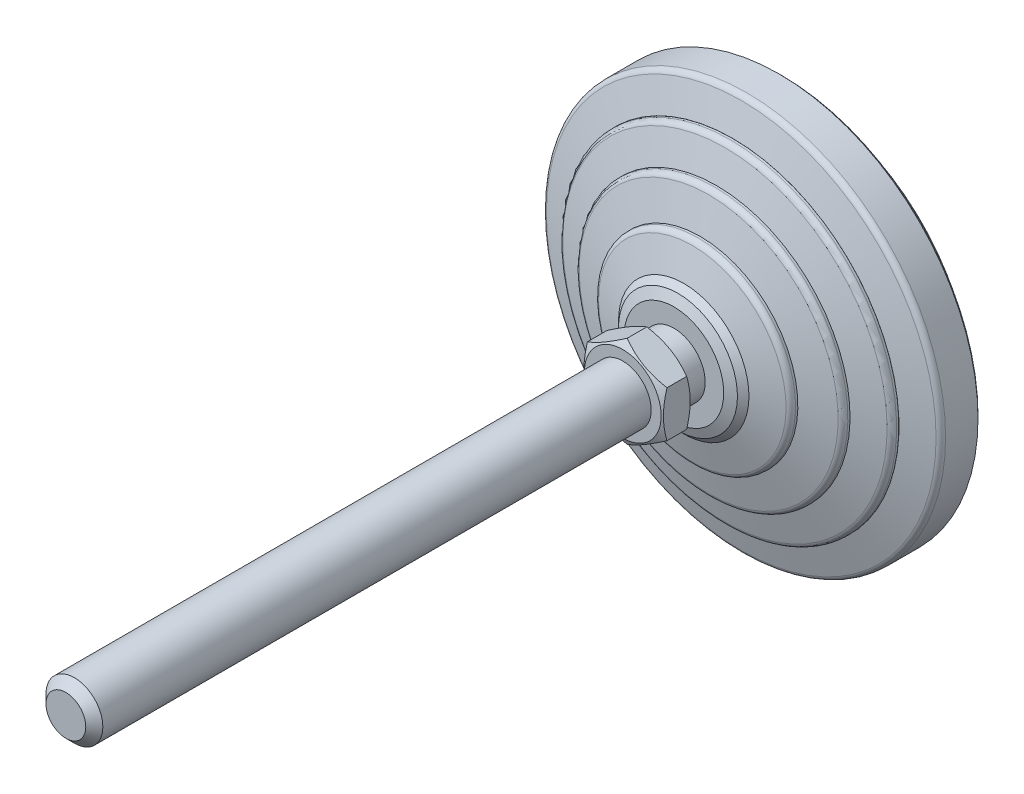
ISO-10303-21;
HEADER;
FILE_DESCRIPTION(('STEP AP214'),'2;1');
FILE_NAME('part.step','',(''),(''),'','','');
FILE_SCHEMA(('AUTOMOTIVE_DESIGN { 1 0 10303 214 1 1 1 1 }'));
ENDSEC;
DATA;
#1=APPLICATION_CONTEXT('core data for automotive mechanical design processes');
#2=APPLICATION_PROTOCOL_DEFINITION('international standard','automotive_design',2000,#1);
#3=PRODUCT_CONTEXT('',#1,'mechanical');
#4=PRODUCT('Part','Part','',(#3));
#5=PRODUCT_RELATED_PRODUCT_CATEGORY('part','',(#4));
#6=PRODUCT_DEFINITION_FORMATION('','',#4);
#7=PRODUCT_DEFINITION_CONTEXT('part definition',#1,'design');
#8=PRODUCT_DEFINITION('design','',#6,#7);
#9=PRODUCT_DEFINITION_SHAPE('','',#8);
#10=(LENGTH_UNIT() NAMED_UNIT(*) SI_UNIT(.MILLI.,.METRE.));
#11=(NAMED_UNIT(*) PLANE_ANGLE_UNIT() SI_UNIT($,.RADIAN.));
#12=(NAMED_UNIT(*) SI_UNIT($,.STERADIAN.) SOLID_ANGLE_UNIT());
#13=UNCERTAINTY_MEASURE_WITH_UNIT(LENGTH_MEASURE(1.E-05),#10,'distance_accuracy_value','');
#14=(GEOMETRIC_REPRESENTATION_CONTEXT(3) GLOBAL_UNCERTAINTY_ASSIGNED_CONTEXT((#13)) GLOBAL_UNIT_ASSIGNED_CONTEXT((#10,
#11,#12)) REPRESENTATION_CONTEXT('',''));
#15=CARTESIAN_POINT('',(0.,0.,0.));
#16=DIRECTION('',(0.,0.,1.));
#17=DIRECTION('',(1.,0.,0.));
#18=AXIS2_PLACEMENT_3D('',#15,#16,#17);
#19=CARTESIAN_POINT('',(-5.5,0.,26.));
#20=DIRECTION('',(0.,0.,1.));
#21=DIRECTION('',(0.,-1.,0.));
#22=AXIS2_PLACEMENT_3D('',#19,#20,#21);
#23=PLANE('',#22);
#24=CARTESIAN_POINT('',(0.,0.,25.9999999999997));
#25=DIRECTION('',(0.,0.,-1.));
#26=DIRECTION('',(-1.,0.,0.));
#27=AXIS2_PLACEMENT_3D('',#24,#25,#26);
#28=CIRCLE('',#27,6.75);
#29=CARTESIAN_POINT('',(-6.75,0.,25.9999999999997));
#30=VERTEX_POINT('',#29);
#31=EDGE_CURVE('E596',#30,#30,#28,.T.);
#32=ORIENTED_EDGE('',*,*,#31,.T.);
#33=EDGE_LOOP('',(#32));
#34=FACE_BOUND('',#33,.T.);
#35=CARTESIAN_POINT('',(0.,0.,26.));
#36=DIRECTION('',(0.,0.,-1.));
#37=DIRECTION('',(0.,1.,0.));
#38=AXIS2_PLACEMENT_3D('',#35,#36,#37);
#39=CIRCLE('',#38,5.5);
#40=CARTESIAN_POINT('',(0.,5.5,26.));
#41=VERTEX_POINT('',#40);
#42=EDGE_CURVE('E156',#41,#41,#39,.T.);
#43=ORIENTED_EDGE('',*,*,#42,.F.);
#44=EDGE_LOOP('',(#43));
#45=FACE_BOUND('',#44,.T.);
#46=ADVANCED_FACE('F14',(#34,#45),#23,.F.);
#47=CARTESIAN_POINT('',(0.,0.,0.));
#48=DIRECTION('',(0.,0.,-1.));
#49=DIRECTION('',(0.,1.,0.));
#50=AXIS2_PLACEMENT_3D('',#47,#48,#49);
#51=CYLINDRICAL_SURFACE('',#50,5.5);
#52=CARTESIAN_POINT('',(0.,0.,22.));
#53=DIRECTION('',(0.,0.,-1.));
#54=DIRECTION('',(0.,1.,0.));
#55=AXIS2_PLACEMENT_3D('',#52,#53,#54);
#56=CIRCLE('',#55,5.5);
#57=CARTESIAN_POINT('',(0.,5.5,22.));
#58=VERTEX_POINT('',#57);
#59=EDGE_CURVE('E153',#58,#58,#56,.T.);
#60=ORIENTED_EDGE('',*,*,#59,.F.);
#61=EDGE_LOOP('',(#60));
#62=FACE_BOUND('',#61,.T.);
#63=ORIENTED_EDGE('',*,*,#42,.T.);
#64=EDGE_LOOP('',(#63));
#65=FACE_BOUND('',#64,.T.);
#66=ADVANCED_FACE('F180',(#62,#65),#51,.T.);
#67=CARTESIAN_POINT('',(-8.75409836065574,0.,22.));
#68=DIRECTION('',(0.,0.,-1.));
#69=DIRECTION('',(0.,1.,0.));
#70=AXIS2_PLACEMENT_3D('',#67,#68,#69);
#71=PLANE('',#70);
#72=CARTESIAN_POINT('',(0.,0.,22.));
#73=DIRECTION('',(0.,0.,-1.));
#74=DIRECTION('',(0.,1.,0.));
#75=AXIS2_PLACEMENT_3D('',#72,#73,#74);
#76=CIRCLE('',#75,8.75409836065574);
#77=CARTESIAN_POINT('',(0.,8.75409836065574,22.));
#78=VERTEX_POINT('',#77);
#79=EDGE_CURVE('E150',#78,#78,#76,.T.);
#80=ORIENTED_EDGE('',*,*,#79,.F.);
#81=EDGE_LOOP('',(#80));
#82=FACE_BOUND('',#81,.T.);
#83=ORIENTED_EDGE('',*,*,#59,.T.);
#84=EDGE_LOOP('',(#83));
#85=FACE_BOUND('',#84,.T.);
#86=ADVANCED_FACE('F187',(#82,#85),#71,.F.);
#87=CARTESIAN_POINT('',(0.,0.,22.));
#88=DIRECTION('',(0.,0.,-1.));
#89=DIRECTION('',(0.,1.,0.));
#90=AXIS2_PLACEMENT_3D('',#87,#88,#89);
#91=CONICAL_SURFACE('',#90,8.75409836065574,1.17809724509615);
#92=CARTESIAN_POINT('',(0.,0.,21.2928932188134));
#93=DIRECTION('',(0.,0.,-1.));
#94=DIRECTION('',(0.,1.,0.));
#95=AXIS2_PLACEMENT_3D('',#92,#93,#94);
#96=CIRCLE('',#95,10.4612051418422);
#97=CARTESIAN_POINT('',(0.,10.4612051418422,21.2928932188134));
#98=VERTEX_POINT('',#97);
#99=EDGE_CURVE('E147',#98,#98,#96,.T.);
#100=ORIENTED_EDGE('',*,*,#99,.F.);
#101=EDGE_LOOP('',(#100));
#102=FACE_BOUND('',#101,.T.);
#103=ORIENTED_EDGE('',*,*,#79,.T.);
#104=EDGE_LOOP('',(#103));
#105=FACE_BOUND('',#104,.T.);
#106=ADVANCED_FACE('F459',(#102,#105),#91,.T.);
#107=CARTESIAN_POINT('',(0.,0.,21.2928932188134));
#108=DIRECTION('',(0.,0.,-1.));
#109=DIRECTION('',(0.,1.,0.));
#110=AXIS2_PLACEMENT_3D('',#107,#108,#109);
#111=CONICAL_SURFACE('',#110,10.4612051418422,0.785398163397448);
#112=CARTESIAN_POINT('',(0.,0.,20.2786885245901));
#113=DIRECTION('',(0.,0.,-1.));
#114=DIRECTION('',(0.,1.,0.));
#115=AXIS2_PLACEMENT_3D('',#112,#113,#114);
#116=CIRCLE('',#115,11.4754098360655);
#117=CARTESIAN_POINT('',(0.,11.4754098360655,20.2786885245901));
#118=VERTEX_POINT('',#117);
#119=EDGE_CURVE('E144',#118,#118,#116,.T.);
#120=ORIENTED_EDGE('',*,*,#119,.F.);
#121=EDGE_LOOP('',(#120));
#122=FACE_BOUND('',#121,.T.);
#123=ORIENTED_EDGE('',*,*,#99,.T.);
#124=EDGE_LOOP('',(#123));
#125=FACE_BOUND('',#124,.T.);
#126=ADVANCED_FACE('F449',(#122,#125),#111,.T.);
#127=CARTESIAN_POINT('',(0.,0.,20.2786885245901));
#128=DIRECTION('',(0.,0.,-1.));
#129=DIRECTION('',(0.,1.,0.));
#130=AXIS2_PLACEMENT_3D('',#127,#128,#129);
#131=CONICAL_SURFACE('',#130,11.4754098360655,1.27933953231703);
#132=CARTESIAN_POINT('',(0.,0.,18.7711726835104));
#133=DIRECTION('',(0.,0.,-1.));
#134=DIRECTION('',(0.,1.,0.));
#135=AXIS2_PLACEMENT_3D('',#132,#133,#134);
#136=CIRCLE('',#135,16.5004626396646);
#137=CARTESIAN_POINT('',(0.,16.5004626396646,18.7711726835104));
#138=VERTEX_POINT('',#137);
#139=EDGE_CURVE('E141',#138,#138,#136,.T.);
#140=ORIENTED_EDGE('',*,*,#139,.F.);
#141=EDGE_LOOP('',(#140));
#142=FACE_BOUND('',#141,.T.);
#143=ORIENTED_EDGE('',*,*,#119,.T.);
#144=EDGE_LOOP('',(#143));
#145=FACE_BOUND('',#144,.T.);
#146=ADVANCED_FACE('F439',(#142,#145),#131,.T.);
#147=CARTESIAN_POINT('',(0.,0.,17.8133463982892));
#148=DIRECTION('',(0.,0.,-1.));
#149=DIRECTION('',(0.,1.,0.));
#150=AXIS2_PLACEMENT_3D('',#147,#148,#149);
#151=TOROIDAL_SURFACE('',#150,16.2131147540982,1.);
#152=CARTESIAN_POINT('',(0.,0.,17.8133463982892));
#153=DIRECTION('',(0.,0.,-1.));
#154=DIRECTION('',(0.,1.,0.));
#155=AXIS2_PLACEMENT_3D('',#152,#153,#154);
#156=CIRCLE('',#155,17.2131147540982);
#157=CARTESIAN_POINT('',(0.,17.2131147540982,17.8133463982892));
#158=VERTEX_POINT('',#157);
#159=EDGE_CURVE('E138',#158,#158,#156,.T.);
#160=ORIENTED_EDGE('',*,*,#159,.F.);
#161=EDGE_LOOP('',(#160));
#162=FACE_BOUND('',#161,.T.);
#163=ORIENTED_EDGE('',*,*,#139,.T.);
#164=EDGE_LOOP('',(#163));
#165=FACE_BOUND('',#164,.T.);
#166=ADVANCED_FACE('F429',(#162,#165),#151,.T.);
#167=CARTESIAN_POINT('',(0.,0.,0.));
#168=DIRECTION('',(0.,0.,-1.));
#169=DIRECTION('',(0.,1.,0.));
#170=AXIS2_PLACEMENT_3D('',#167,#168,#169);
#171=CYLINDRICAL_SURFACE('',#170,17.2131147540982);
#172=CARTESIAN_POINT('',(0.,0.,17.4098360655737));
#173=DIRECTION('',(0.,0.,-1.));
#174=DIRECTION('',(0.,1.,0.));
#175=AXIS2_PLACEMENT_3D('',#172,#173,#174);
#176=CIRCLE('',#175,17.2131147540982);
#177=CARTESIAN_POINT('',(0.,17.2131147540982,17.4098360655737));
#178=VERTEX_POINT('',#177);
#179=EDGE_CURVE('E135',#178,#178,#176,.T.);
#180=ORIENTED_EDGE('',*,*,#179,.F.);
#181=EDGE_LOOP('',(#180));
#182=FACE_BOUND('',#181,.T.);
#183=ORIENTED_EDGE('',*,*,#159,.T.);
#184=EDGE_LOOP('',(#183));
#185=FACE_BOUND('',#184,.T.);
#186=ADVANCED_FACE('F419',(#182,#185),#171,.T.);
#187=CARTESIAN_POINT('',(0.,0.,17.4098360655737));
#188=DIRECTION('',(0.,0.,-1.));
#189=DIRECTION('',(0.,1.,0.));
#190=AXIS2_PLACEMENT_3D('',#187,#188,#189);
#191=CONICAL_SURFACE('',#190,17.2131147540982,1.30454427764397);
#192=CARTESIAN_POINT('',(0.,0.,15.8894925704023));
#193=DIRECTION('',(0.,0.,-1.));
#194=DIRECTION('',(0.,1.,0.));
#195=AXIS2_PLACEMENT_3D('',#192,#193,#194);
#196=CIRCLE('',#195,22.7877075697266);
#197=CARTESIAN_POINT('',(0.,22.7877075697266,15.8894925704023));
#198=VERTEX_POINT('',#197);
#199=EDGE_CURVE('E132',#198,#198,#196,.T.);
#200=ORIENTED_EDGE('',*,*,#199,.F.);
#201=EDGE_LOOP('',(#200));
#202=FACE_BOUND('',#201,.T.);
#203=ORIENTED_EDGE('',*,*,#179,.T.);
#204=EDGE_LOOP('',(#203));
#205=FACE_BOUND('',#204,.T.);
#206=ADVANCED_FACE('F409',(#202,#205),#191,.T.);
#207=CARTESIAN_POINT('',(0.,0.,14.9247287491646));
#208=DIRECTION('',(0.,0.,-1.));
#209=DIRECTION('',(0.,1.,0.));
#210=AXIS2_PLACEMENT_3D('',#207,#208,#209);
#211=TOROIDAL_SURFACE('',#210,22.5245901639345,1.);
#212=CARTESIAN_POINT('',(0.,0.,14.9247287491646));
#213=DIRECTION('',(0.,0.,-1.));
#214=DIRECTION('',(0.,1.,0.));
#215=AXIS2_PLACEMENT_3D('',#212,#213,#214);
#216=CIRCLE('',#215,23.5245901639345);
#217=CARTESIAN_POINT('',(0.,23.5245901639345,14.9247287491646));
#218=VERTEX_POINT('',#217);
#219=EDGE_CURVE('E129',#218,#218,#216,.T.);
#220=ORIENTED_EDGE('',*,*,#219,.F.);
#221=EDGE_LOOP('',(#220));
#222=FACE_BOUND('',#221,.T.);
#223=ORIENTED_EDGE('',*,*,#199,.T.);
#224=EDGE_LOOP('',(#223));
#225=FACE_BOUND('',#224,.T.);
#226=ADVANCED_FACE('F399',(#222,#225),#211,.T.);
#227=CARTESIAN_POINT('',(0.,0.,0.));
#228=DIRECTION('',(0.,0.,-1.));
#229=DIRECTION('',(0.,1.,0.));
#230=AXIS2_PLACEMENT_3D('',#227,#228,#229);
#231=CYLINDRICAL_SURFACE('',#230,23.5245901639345);
#232=CARTESIAN_POINT('',(0.,0.,14.5409836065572));
#233=DIRECTION('',(0.,0.,-1.));
#234=DIRECTION('',(0.,1.,0.));
#235=AXIS2_PLACEMENT_3D('',#232,#233,#234);
#236=CIRCLE('',#235,23.5245901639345);
#237=CARTESIAN_POINT('',(0.,23.5245901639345,14.5409836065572));
#238=VERTEX_POINT('',#237);
#239=EDGE_CURVE('E126',#238,#238,#236,.T.);
#240=ORIENTED_EDGE('',*,*,#239,.F.);
#241=EDGE_LOOP('',(#240));
#242=FACE_BOUND('',#241,.T.);
#243=ORIENTED_EDGE('',*,*,#219,.T.);
#244=EDGE_LOOP('',(#243));
#245=FACE_BOUND('',#244,.T.);
#246=ADVANCED_FACE('F389',(#242,#245),#231,.T.);
#247=CARTESIAN_POINT('',(0.,0.,14.5409836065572));
#248=DIRECTION('',(0.,0.,-1.));
#249=DIRECTION('',(0.,1.,0.));
#250=AXIS2_PLACEMENT_3D('',#247,#248,#249);
#251=CONICAL_SURFACE('',#250,23.5245901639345,1.2787125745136);
#252=CARTESIAN_POINT('',(0.,0.,13.0337743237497));
#253=DIRECTION('',(0.,0.,-1.));
#254=DIRECTION('',(0.,1.,0.));
#255=AXIS2_PLACEMENT_3D('',#252,#253,#254);
#256=CIRCLE('',#255,28.5372004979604);
#257=CARTESIAN_POINT('',(0.,28.5372004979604,13.0337743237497));
#258=VERTEX_POINT('',#257);
#259=EDGE_CURVE('E123',#258,#258,#256,.T.);
#260=ORIENTED_EDGE('',*,*,#259,.F.);
#261=EDGE_LOOP('',(#260));
#262=FACE_BOUND('',#261,.T.);
#263=ORIENTED_EDGE('',*,*,#239,.T.);
#264=EDGE_LOOP('',(#263));
#265=FACE_BOUND('',#264,.T.);
#266=ADVANCED_FACE('F379',(#262,#265),#251,.T.);
#267=CARTESIAN_POINT('',(0.,0.,12.0761283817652));
#268=DIRECTION('',(0.,0.,-1.));
#269=DIRECTION('',(0.,1.,0.));
#270=AXIS2_PLACEMENT_3D('',#267,#268,#269);
#271=TOROIDAL_SURFACE('',#270,28.2492521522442,1.);
#272=CARTESIAN_POINT('',(0.,0.,12.0761283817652));
#273=DIRECTION('',(0.,0.,-1.));
#274=DIRECTION('',(0.,1.,0.));
#275=AXIS2_PLACEMENT_3D('',#272,#273,#274);
#276=CIRCLE('',#275,29.2492521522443);
#277=CARTESIAN_POINT('',(0.,29.2492521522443,12.0761283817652));
#278=VERTEX_POINT('',#277);
#279=EDGE_CURVE('E120',#278,#278,#276,.T.);
#280=ORIENTED_EDGE('',*,*,#279,.F.);
#281=EDGE_LOOP('',(#280));
#282=FACE_BOUND('',#281,.T.);
#283=ORIENTED_EDGE('',*,*,#259,.T.);
#284=EDGE_LOOP('',(#283));
#285=FACE_BOUND('',#284,.T.);
#286=ADVANCED_FACE('F369',(#282,#285),#271,.T.);
#287=CARTESIAN_POINT('',(0.,0.,0.));
#288=DIRECTION('',(0.,0.,-1.));
#289=DIRECTION('',(0.,1.,0.));
#290=AXIS2_PLACEMENT_3D('',#287,#288,#289);
#291=CYLINDRICAL_SURFACE('',#290,29.2492521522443);
#292=CARTESIAN_POINT('',(0.,0.,11.6721311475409));
#293=DIRECTION('',(0.,0.,-1.));
#294=DIRECTION('',(0.,1.,0.));
#295=AXIS2_PLACEMENT_3D('',#292,#293,#294);
#296=CIRCLE('',#295,29.2492521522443);
#297=CARTESIAN_POINT('',(0.,29.2492521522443,11.6721311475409));
#298=VERTEX_POINT('',#297);
#299=EDGE_CURVE('E117',#298,#298,#296,.T.);
#300=ORIENTED_EDGE('',*,*,#299,.F.);
#301=EDGE_LOOP('',(#300));
#302=FACE_BOUND('',#301,.T.);
#303=ORIENTED_EDGE('',*,*,#279,.T.);
#304=EDGE_LOOP('',(#303));
#305=FACE_BOUND('',#304,.T.);
#306=ADVANCED_FACE('F359',(#302,#305),#291,.T.);
#307=CARTESIAN_POINT('',(-29.2622950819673,0.,11.6721311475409));
#308=DIRECTION('',(0.,0.,-1.));
#309=DIRECTION('',(0.,1.,0.));
#310=AXIS2_PLACEMENT_3D('',#307,#308,#309);
#311=PLANE('',#310);
#312=CARTESIAN_POINT('',(0.,0.,11.6721311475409));
#313=DIRECTION('',(0.,0.,-1.));
#314=DIRECTION('',(0.,1.,0.));
#315=AXIS2_PLACEMENT_3D('',#312,#313,#314);
#316=CIRCLE('',#315,29.2622950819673);
#317=CARTESIAN_POINT('',(0.,29.2622950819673,11.6721311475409));
#318=VERTEX_POINT('',#317);
#319=EDGE_CURVE('E114',#318,#318,#316,.T.);
#320=ORIENTED_EDGE('',*,*,#319,.F.);
#321=EDGE_LOOP('',(#320));
#322=FACE_BOUND('',#321,.T.);
#323=ORIENTED_EDGE('',*,*,#299,.T.);
#324=EDGE_LOOP('',(#323));
#325=FACE_BOUND('',#324,.T.);
#326=ADVANCED_FACE('F349',(#322,#325),#311,.F.);
#327=CARTESIAN_POINT('',(0.,0.,11.6721311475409));
#328=DIRECTION('',(0.,0.,-1.));
#329=DIRECTION('',(0.,1.,0.));
#330=AXIS2_PLACEMENT_3D('',#327,#328,#329);
#331=CONICAL_SURFACE('',#330,29.2622950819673,1.27933953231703);
#332=CARTESIAN_POINT('',(0.,0.,10.1646153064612));
#333=DIRECTION('',(0.,0.,-1.));
#334=DIRECTION('',(0.,1.,0.));
#335=AXIS2_PLACEMENT_3D('',#332,#333,#334);
#336=CIRCLE('',#335,34.2873478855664);
#337=CARTESIAN_POINT('',(0.,34.2873478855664,10.1646153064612));
#338=VERTEX_POINT('',#337);
#339=EDGE_CURVE('E111',#338,#338,#336,.T.);
#340=ORIENTED_EDGE('',*,*,#339,.F.);
#341=EDGE_LOOP('',(#340));
#342=FACE_BOUND('',#341,.T.);
#343=ORIENTED_EDGE('',*,*,#319,.T.);
#344=EDGE_LOOP('',(#343));
#345=FACE_BOUND('',#344,.T.);
#346=ADVANCED_FACE('F339',(#342,#345),#331,.T.);
#347=CARTESIAN_POINT('',(0.,0.,9.20678902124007));
#348=DIRECTION('',(0.,0.,-1.));
#349=DIRECTION('',(0.,1.,0.));
#350=AXIS2_PLACEMENT_3D('',#347,#348,#349);
#351=TOROIDAL_SURFACE('',#350,34.,1.);
#352=CARTESIAN_POINT('',(0.,0.,9.20678902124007));
#353=DIRECTION('',(0.,0.,-1.));
#354=DIRECTION('',(0.,1.,0.));
#355=AXIS2_PLACEMENT_3D('',#352,#353,#354);
#356=CIRCLE('',#355,35.);
#357=CARTESIAN_POINT('',(0.,35.,9.20678902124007));
#358=VERTEX_POINT('',#357);
#359=EDGE_CURVE('E108',#358,#358,#356,.T.);
#360=ORIENTED_EDGE('',*,*,#359,.F.);
#361=EDGE_LOOP('',(#360));
#362=FACE_BOUND('',#361,.T.);
#363=ORIENTED_EDGE('',*,*,#339,.T.);
#364=EDGE_LOOP('',(#363));
#365=FACE_BOUND('',#364,.T.);
#366=ADVANCED_FACE('F329',(#362,#365),#351,.T.);
#367=CARTESIAN_POINT('',(0.,0.,0.));
#368=DIRECTION('',(0.,0.,-1.));
#369=DIRECTION('',(0.,1.,0.));
#370=AXIS2_PLACEMENT_3D('',#367,#368,#369);
#371=CYLINDRICAL_SURFACE('',#370,35.);
#372=CARTESIAN_POINT('',(0.,0.,3.5));
#373=DIRECTION('',(0.,0.,-1.));
#374=DIRECTION('',(0.,1.,0.));
#375=AXIS2_PLACEMENT_3D('',#372,#373,#374);
#376=CIRCLE('',#375,35.);
#377=CARTESIAN_POINT('',(0.,35.,3.5));
#378=VERTEX_POINT('',#377);
#379=EDGE_CURVE('E105',#378,#378,#376,.T.);
#380=ORIENTED_EDGE('',*,*,#379,.F.);
#381=EDGE_LOOP('',(#380));
#382=FACE_BOUND('',#381,.T.);
#383=ORIENTED_EDGE('',*,*,#359,.T.);
#384=EDGE_LOOP('',(#383));
#385=FACE_BOUND('',#384,.T.);
#386=ADVANCED_FACE('F319',(#382,#385),#371,.T.);
#387=CARTESIAN_POINT('',(0.,0.,3.5));
#388=DIRECTION('',(0.,0.,1.));
#389=DIRECTION('',(0.,-1.,0.));
#390=AXIS2_PLACEMENT_3D('',#387,#388,#389);
#391=CONICAL_SURFACE('',#390,35.,0.785398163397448);
#392=CARTESIAN_POINT('',(0.,0.,3.));
#393=DIRECTION('',(0.,0.,-1.));
#394=DIRECTION('',(0.,1.,0.));
#395=AXIS2_PLACEMENT_3D('',#392,#393,#394);
#396=CIRCLE('',#395,34.5);
#397=CARTESIAN_POINT('',(0.,34.5,3.));
#398=VERTEX_POINT('',#397);
#399=EDGE_CURVE('E102',#398,#398,#396,.T.);
#400=ORIENTED_EDGE('',*,*,#399,.F.);
#401=EDGE_LOOP('',(#400));
#402=FACE_BOUND('',#401,.T.);
#403=ORIENTED_EDGE('',*,*,#379,.T.);
#404=EDGE_LOOP('',(#403));
#405=FACE_BOUND('',#404,.T.);
#406=ADVANCED_FACE('F309',(#402,#405),#391,.T.);
#407=CARTESIAN_POINT('',(-34.5,0.,3.));
#408=DIRECTION('',(0.,0.,1.));
#409=DIRECTION('',(0.,-1.,0.));
#410=AXIS2_PLACEMENT_3D('',#407,#408,#409);
#411=PLANE('',#410);
#412=CARTESIAN_POINT('',(0.,0.,3.));
#413=DIRECTION('',(0.,0.,-1.));
#414=DIRECTION('',(0.,1.,0.));
#415=AXIS2_PLACEMENT_3D('',#412,#413,#414);
#416=CIRCLE('',#415,30.4098360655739);
#417=CARTESIAN_POINT('',(0.,30.4098360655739,3.));
#418=VERTEX_POINT('',#417);
#419=EDGE_CURVE('E99',#418,#418,#416,.T.);
#420=ORIENTED_EDGE('',*,*,#419,.F.);
#421=EDGE_LOOP('',(#420));
#422=FACE_BOUND('',#421,.T.);
#423=ORIENTED_EDGE('',*,*,#399,.T.);
#424=EDGE_LOOP('',(#423));
#425=FACE_BOUND('',#424,.T.);
#426=ADVANCED_FACE('F299',(#422,#425),#411,.F.);
#427=CARTESIAN_POINT('',(0.,0.,0.));
#428=DIRECTION('',(0.,0.,-1.));
#429=DIRECTION('',(0.,1.,0.));
#430=AXIS2_PLACEMENT_3D('',#427,#428,#429);
#431=CYLINDRICAL_SURFACE('',#430,30.4098360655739);
#432=CARTESIAN_POINT('',(0.,0.,0.));
#433=DIRECTION('',(0.,0.,-1.));
#434=DIRECTION('',(0.,1.,0.));
#435=AXIS2_PLACEMENT_3D('',#432,#433,#434);
#436=CIRCLE('',#435,30.4098360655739);
#437=CARTESIAN_POINT('',(0.,30.4098360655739,0.));
#438=VERTEX_POINT('',#437);
#439=EDGE_CURVE('E96',#438,#438,#436,.T.);
#440=ORIENTED_EDGE('',*,*,#439,.F.);
#441=EDGE_LOOP('',(#440));
#442=FACE_BOUND('',#441,.T.);
#443=ORIENTED_EDGE('',*,*,#419,.T.);
#444=EDGE_LOOP('',(#443));
#445=FACE_BOUND('',#444,.T.);
#446=ADVANCED_FACE('F288',(#442,#445),#431,.T.);
#447=CARTESIAN_POINT('',(-30.4098360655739,0.,0.));
#448=DIRECTION('',(0.,0.,1.));
#449=DIRECTION('',(0.,-1.,0.));
#450=AXIS2_PLACEMENT_3D('',#447,#448,#449);
#451=PLANE('',#450);
#452=ORIENTED_EDGE('',*,*,#439,.T.);
#453=EDGE_LOOP('',(#452));
#454=FACE_BOUND('',#453,.T.);
#455=ADVANCED_FACE('F178',(#454),#451,.F.);
#456=CARTESIAN_POINT('',(0.,0.,27.5358730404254));
#457=DIRECTION('',(0.,0.,1.));
#458=DIRECTION('',(1.,0.,0.));
#459=AXIS2_PLACEMENT_3D('',#456,#457,#458);
#460=CONICAL_SURFACE('',#459,9.41021013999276,1.04719755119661);
#461=CARTESIAN_POINT('',(0.256230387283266,-8.23083845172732,26.8572645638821));
#462=CARTESIAN_POINT('',(-0.0703926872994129,-8.04226253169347,26.7425620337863));
#463=CARTESIAN_POINT('',(-0.400070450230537,-7.85192298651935,26.6375848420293));
#464=CARTESIAN_POINT('',(-1.06580362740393,-7.46756175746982,26.4532939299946));
#465=CARTESIAN_POINT('',(-1.40187589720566,-7.27353034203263,26.3740623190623));
#466=CARTESIAN_POINT('',(-1.90456513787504,-6.98330257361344,26.2806287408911));
#467=CARTESIAN_POINT('',(-2.06943505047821,-6.88811488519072,26.253939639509));
#468=CARTESIAN_POINT('',(-2.40003749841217,-6.6972414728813,26.2089113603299));
#469=CARTESIAN_POINT('',(-2.56577004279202,-6.60155574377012,26.1905722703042));
#470=CARTESIAN_POINT('',(-2.89752799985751,-6.41001519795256,26.1627673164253));
#471=CARTESIAN_POINT('',(-3.06355250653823,-6.31416090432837,26.1532871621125));
#472=CARTESIAN_POINT('',(-3.39580513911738,-6.12233475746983,26.1434199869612));
#473=CARTESIAN_POINT('',(-3.56203326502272,-6.02636290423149,26.1430329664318));
#474=CARTESIAN_POINT('',(-3.9047227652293,-5.82851102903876,26.1516266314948));
#475=CARTESIAN_POINT('',(-4.08117318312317,-5.72663733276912,26.1611953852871));
#476=CARTESIAN_POINT('',(-4.4334543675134,-5.52324769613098,26.19030687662));
#477=CARTESIAN_POINT('',(-4.60928511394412,-5.42173176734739,26.2098499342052));
#478=CARTESIAN_POINT('',(-4.96029575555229,-5.21907567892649,26.2583597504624));
#479=CARTESIAN_POINT('',(-5.13547380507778,-5.11793658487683,26.2873441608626));
#480=CARTESIAN_POINT('',(-5.48459968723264,-4.91636866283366,26.353932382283));
#481=CARTESIAN_POINT('',(-5.65854742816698,-4.81593988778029,26.3915368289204));
#482=CARTESIAN_POINT('',(-6.01058051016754,-4.61269349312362,26.4757901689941));
#483=CARTESIAN_POINT('',(-6.18862059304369,-4.50990200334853,26.5226895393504));
#484=CARTESIAN_POINT('',(-6.54316755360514,-4.30520422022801,26.6237105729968));
#485=CARTESIAN_POINT('',(-6.71967426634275,-4.20329802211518,26.6778330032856));
#486=CARTESIAN_POINT('',(-7.07042093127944,-4.00079434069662,26.7920961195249));
#487=CARTESIAN_POINT('',(-7.24466724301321,-3.90019318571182,26.8522109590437));
#488=CARTESIAN_POINT('',(-7.5916413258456,-3.69986760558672,26.9777829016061));
#489=CARTESIAN_POINT('',(-7.76436964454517,-3.60014286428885,27.0432379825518));
#490=CARTESIAN_POINT('',(-7.93640853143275,-3.50081616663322,27.1109556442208));
#491=B_SPLINE_CURVE_WITH_KNOTS('',3,(#461,#462,#463,#464,#465,#466,#467,#468,#469,#470,#471,
#472,#473,#474,#475,#476,#477,#478,#479,#480,#481,#482,#483,#484,#485,#486,#487,#488,#489,#490),
.UNSPECIFIED.,.F.,.F.,(4,2,2,2,2,2,2,2,2,2,2,2,2,2,4),(0.,1.18336939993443,2.37047665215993,
2.94701898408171,3.52356737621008,4.09918411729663,4.67480087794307,5.28645938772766,
5.89813752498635,6.51096589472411,7.12383946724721,7.75628452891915,8.38879680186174,
9.01869015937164,9.6483461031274),.UNSPECIFIED.);
#492=CARTESIAN_POINT('',(0.,-8.08290376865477,26.7695523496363));
#493=VERTEX_POINT('',#492);
#494=CARTESIAN_POINT('',(-7.,-4.04145188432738,26.7695523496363));
#495=VERTEX_POINT('',#494);
#496=EDGE_CURVE('E73',#493,#495,#491,.T.);
#497=ORIENTED_EDGE('',*,*,#496,.T.);
#498=CARTESIAN_POINT('',(-7.,-10.8050370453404,29.5358937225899));
#499=CARTESIAN_POINT('',(-7.,-10.4997219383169,29.3879935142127));
#500=CARTESIAN_POINT('',(-7.,-10.1937004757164,29.2415262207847));
#501=CARTESIAN_POINT('',(-7.,-9.57986898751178,28.9522644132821));
#502=CARTESIAN_POINT('',(-7.,-9.27205868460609,28.8094704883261));
#503=CARTESIAN_POINT('',(-7.,-8.6526632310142,28.5276330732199));
#504=CARTESIAN_POINT('',(-7.,-8.34106661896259,28.3886146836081));
#505=CARTESIAN_POINT('',(-7.,-7.71537723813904,28.1163353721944));
#506=CARTESIAN_POINT('',(-7.,-7.40128458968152,27.9830741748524));
#507=CARTESIAN_POINT('',(-7.,-6.76016586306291,27.7197493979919));
#508=CARTESIAN_POINT('',(-7.,-6.43304376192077,27.5899183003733));
#509=CARTESIAN_POINT('',(-7.,-5.77495453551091,27.3402057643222));
#510=CARTESIAN_POINT('',(-7.,-5.4439869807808,27.2203254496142));
#511=CARTESIAN_POINT('',(-7.,-4.7783123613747,26.9936992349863));
#512=CARTESIAN_POINT('',(-7.,-4.4436146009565,26.8869263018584));
#513=CARTESIAN_POINT('',(-7.,-3.76943070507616,26.68997294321));
#514=CARTESIAN_POINT('',(-7.,-3.42994613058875,26.5997872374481));
#515=CARTESIAN_POINT('',(-7.,-2.74781191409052,26.4408523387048));
#516=CARTESIAN_POINT('',(-7.,-2.40518962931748,26.3719889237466));
#517=CARTESIAN_POINT('',(-7.,-1.88817724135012,26.2876924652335));
#518=CARTESIAN_POINT('',(-7.,-1.71531353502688,26.2627589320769));
#519=CARTESIAN_POINT('',(-7.,-1.36874429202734,26.2197149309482));
#520=CARTESIAN_POINT('',(-7.,-1.19503883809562,26.2016038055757));
#521=CARTESIAN_POINT('',(-7.,-0.84926566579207,26.1727899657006));
#522=CARTESIAN_POINT('',(-7.,-0.677205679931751,26.1619948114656));
#523=CARTESIAN_POINT('',(-7.,-0.332783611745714,26.1476866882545));
#524=CARTESIAN_POINT('',(-7.,-0.160421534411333,26.1441736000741));
#525=CARTESIAN_POINT('',(-7.,0.184297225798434,26.1445132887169));
#526=CARTESIAN_POINT('',(-7.,0.356653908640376,26.1483661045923));
#527=CARTESIAN_POINT('',(-7.,0.701053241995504,26.1633443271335));
#528=CARTESIAN_POINT('',(-7.,0.873095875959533,26.17447010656));
#529=CARTESIAN_POINT('',(-7.,1.28811889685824,26.2098480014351));
#530=CARTESIAN_POINT('',(-7.,1.53080398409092,26.2376370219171));
#531=CARTESIAN_POINT('',(-7.,2.01432797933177,26.3061589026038));
#532=CARTESIAN_POINT('',(-7.,2.2551666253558,26.346893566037));
#533=CARTESIAN_POINT('',(-7.,2.97466279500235,26.4863521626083));
#534=CARTESIAN_POINT('',(-7.,3.45002274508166,26.6023039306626));
#535=CARTESIAN_POINT('',(-7.,4.16074743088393,26.8028080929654));
#536=CARTESIAN_POINT('',(-7.,4.39981280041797,26.8749924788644));
#537=CARTESIAN_POINT('',(-7.,4.87562061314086,27.026717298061));
#538=CARTESIAN_POINT('',(-7.,5.11236304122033,27.1062577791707));
#539=CARTESIAN_POINT('',(-7.,5.5836021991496,27.2714303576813));
#540=CARTESIAN_POINT('',(-7.,5.81809967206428,27.3570603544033));
#541=CARTESIAN_POINT('',(-7.,6.28516127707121,27.5334185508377));
#542=CARTESIAN_POINT('',(-7.,6.51772542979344,27.6241466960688));
#543=CARTESIAN_POINT('',(-7.,7.05822832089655,27.8407455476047));
#544=CARTESIAN_POINT('',(-7.,7.3655044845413,27.968266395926));
#545=CARTESIAN_POINT('',(-7.,7.97751566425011,28.229283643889));
#546=CARTESIAN_POINT('',(-7.,8.28225053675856,28.3627803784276));
#547=CARTESIAN_POINT('',(-7.,8.88963571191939,28.6345725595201));
#548=CARTESIAN_POINT('',(-7.,9.1922856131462,28.7728689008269));
#549=CARTESIAN_POINT('',(-7.,9.795796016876,29.0533190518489));
#550=CARTESIAN_POINT('',(-7.,10.0966564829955,29.1954729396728));
#551=CARTESIAN_POINT('',(-7.,10.6971732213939,29.4830700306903));
#552=CARTESIAN_POINT('',(-7.,10.9968279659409,29.6285164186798));
#553=CARTESIAN_POINT('',(-7.,11.5948624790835,29.922009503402));
#554=CARTESIAN_POINT('',(-7.,11.8932422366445,30.0700562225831));
#555=CARTESIAN_POINT('',(-7.,12.7866942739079,30.5173803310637));
#556=CARTESIAN_POINT('',(-7.,13.3801542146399,30.819877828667));
#557=CARTESIAN_POINT('',(-7.,14.5156806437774,31.4060403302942));
#558=CARTESIAN_POINT('',(-7.,15.0579932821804,31.6892305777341));
#559=CARTESIAN_POINT('',(-7.,16.1405969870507,32.2594891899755));
#560=CARTESIAN_POINT('',(-7.,16.6808879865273,32.5465576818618));
#561=CARTESIAN_POINT('',(-7.,17.7586059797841,33.1229718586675));
#562=CARTESIAN_POINT('',(-7.,18.2960367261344,33.4123105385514));
#563=CARTESIAN_POINT('',(-7.,19.3696007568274,33.9933189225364));
#564=CARTESIAN_POINT('',(-7.,19.9057341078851,34.2849885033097));
#565=CARTESIAN_POINT('',(-7.,20.4413875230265,34.5775309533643));
#566=B_SPLINE_CURVE_WITH_KNOTS('',3,(#498,#499,#500,#501,#502,#503,#504,#505,#506,#507,#508,
#509,#510,#511,#512,#513,#514,#515,#516,#517,#518,#519,#520,#521,#522,#523,#524,#525,#526,#527,
#528,#529,#530,#531,#532,#533,#534,#535,#536,#537,#538,#539,#540,#541,#542,#543,#544,#545,#546,
#547,#548,#549,#550,#551,#552,#553,#554,#555,#556,#557,#558,#559,#560,#561,#562,#563,#564,#565),
.UNSPECIFIED.,.F.,.F.,(4,2,2,2,2,2,2,2,2,2,2,2,2,2,2,2,2,2,2,2,2,2,2,2,2,2,2,2,2,2,2,2,2,4),(0.,
1.01776808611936,2.03569839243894,3.05925668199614,4.08276592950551,5.13847407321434,
6.19430127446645,7.2479129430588,8.30118863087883,9.34872027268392,9.87256469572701,
10.3963586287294,10.9134042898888,11.4304414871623,11.9474814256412,12.4645478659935,
13.1969456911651,13.929445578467,15.3952788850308,16.1443947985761,16.8935155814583,
17.6423791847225,18.3912347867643,19.389209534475,20.3872402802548,21.3854580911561,
22.3836961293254,23.3829449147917,24.3822023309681,26.3804676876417,28.2158520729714,
30.0512967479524,31.8823936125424,33.7133942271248),.UNSPECIFIED.);
#567=CARTESIAN_POINT('',(-7.,4.04145188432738,26.7695523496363));
#568=VERTEX_POINT('',#567);
#569=EDGE_CURVE('E81',#495,#568,#566,.T.);
#570=ORIENTED_EDGE('',*,*,#569,.T.);
#571=CARTESIAN_POINT('',(-12.6911460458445,0.755667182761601,29.4430995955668));
#572=CARTESIAN_POINT('',(-12.4223523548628,0.910855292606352,29.2935575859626));
#573=CARTESIAN_POINT('',(-12.1529050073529,1.0664207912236,29.145552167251));
#574=CARTESIAN_POINT('',(-11.6123419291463,1.37851502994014,28.8535107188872));
#575=CARTESIAN_POINT('',(-11.3412258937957,1.53504394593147,28.7094754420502));
#576=CARTESIAN_POINT('',(-10.7953468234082,1.85020737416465,28.4254332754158));
#577=CARTESIAN_POINT('',(-10.5205715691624,2.0088489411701,28.2854575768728));
#578=CARTESIAN_POINT('',(-9.9686836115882,2.3274816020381,28.0118168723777));
#579=CARTESIAN_POINT('',(-9.69157104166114,2.48747261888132,27.8781515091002));
#580=CARTESIAN_POINT('',(-9.13196135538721,2.81056342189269,27.6176531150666));
#581=CARTESIAN_POINT('',(-8.84943815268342,2.97367826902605,27.4908943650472));
#582=CARTESIAN_POINT('',(-8.28095581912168,3.30189169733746,27.2478913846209));
#583=CARTESIAN_POINT('',(-7.99499628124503,3.46699051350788,27.1316484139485));
#584=CARTESIAN_POINT('',(-7.41984662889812,3.7990533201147,26.9130384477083));
#585=CARTESIAN_POINT('',(-7.13066597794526,3.96601184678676,26.8106386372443));
#586=CARTESIAN_POINT('',(-6.54815379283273,4.30232541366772,26.6232692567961));
#587=CARTESIAN_POINT('',(-6.25482373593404,4.47167960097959,26.538293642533));
#588=CARTESIAN_POINT('',(-5.66851455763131,4.81018536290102,26.3913717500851));
#589=CARTESIAN_POINT('',(-5.3756005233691,4.97929935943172,26.3290888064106));
#590=CARTESIAN_POINT('',(-4.93382509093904,5.23435852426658,26.2547522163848));
#591=CARTESIAN_POINT('',(-4.78614637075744,5.319620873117,26.2331530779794));
#592=CARTESIAN_POINT('',(-4.49016705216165,5.49050461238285,26.1967454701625));
#593=CARTESIAN_POINT('',(-4.34186651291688,5.57612596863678,26.1819363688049));
#594=CARTESIAN_POINT('',(-4.04568883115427,5.74712423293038,26.1594988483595));
#595=CARTESIAN_POINT('',(-3.89781394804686,5.83249983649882,26.1518307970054));
#596=CARTESIAN_POINT('',(-3.60191654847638,6.00333627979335,26.1437072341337));
#597=CARTESIAN_POINT('',(-3.45389403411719,6.08879711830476,26.1432516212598));
#598=CARTESIAN_POINT('',(-3.15800174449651,6.25963061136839,26.1495635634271));
#599=CARTESIAN_POINT('',(-3.0101319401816,6.34500328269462,26.1563293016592));
#600=CARTESIAN_POINT('',(-2.71475936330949,6.51553671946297,26.1769236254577));
#601=CARTESIAN_POINT('',(-2.56725661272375,6.60069747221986,26.1907526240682));
#602=CARTESIAN_POINT('',(-2.20331298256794,6.81082042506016,26.2333100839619));
#603=CARTESIAN_POINT('',(-1.98721256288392,6.93558606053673,26.2659906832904));
#604=CARTESIAN_POINT('',(-1.55684038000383,7.18406155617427,26.3446356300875));
#605=CARTESIAN_POINT('',(-1.34256892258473,7.30777123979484,26.3906021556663));
#606=CARTESIAN_POINT('',(-0.702055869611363,7.67757162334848,26.5461062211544));
#607=CARTESIAN_POINT('',(-0.278969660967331,7.92184055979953,26.6731361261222));
#608=CARTESIAN_POINT('',(0.353545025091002,8.2870230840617,26.8901933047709));
#609=CARTESIAN_POINT('',(0.566316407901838,8.40986669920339,26.967953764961));
#610=CARTESIAN_POINT('',(0.989804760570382,8.65436781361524,27.1307378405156));
#611=CARTESIAN_POINT('',(1.20052155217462,8.77602520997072,27.2157620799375));
#612=CARTESIAN_POINT('',(1.61884368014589,9.01754360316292,27.3912898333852));
#613=CARTESIAN_POINT('',(1.82645994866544,9.13741091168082,27.4817589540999));
#614=CARTESIAN_POINT('',(2.23995796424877,9.37614410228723,27.6676174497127));
#615=CARTESIAN_POINT('',(2.44584026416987,9.49501030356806,27.7630051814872));
#616=CARTESIAN_POINT('',(2.65099760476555,9.6134579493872,27.8603840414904));
#617=B_SPLINE_CURVE_WITH_KNOTS('',3,(#571,#572,#573,#574,#575,#576,#577,#578,#579,#580,#581,
#582,#583,#584,#585,#586,#587,#588,#589,#590,#591,#592,#593,#594,#595,#596,#597,#598,#599,#600,
#601,#602,#603,#604,#605,#606,#607,#608,#609,#610,#611,#612,#613,#614,#615,#616),.UNSPECIFIED.,
.F.,.F.,(4,2,2,2,2,2,2,2,2,2,2,2,2,2,2,2,2,2,2,2,2,2,4),(0.,1.03358469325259,2.06736404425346,
3.10767312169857,4.14792322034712,5.19775591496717,6.24771420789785,7.29513824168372,
8.34219831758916,9.37302248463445,9.88856972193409,10.404068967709,10.9166898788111,
11.4293035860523,11.9417883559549,12.4543030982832,13.2088559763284,13.9635326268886,
15.4758505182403,16.2488949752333,17.0220059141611,17.7906623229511,18.5590635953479),.UNSPECIFIED.);
#618=CARTESIAN_POINT('',(0.,8.08290376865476,26.7695523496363));
#619=VERTEX_POINT('',#618);
#620=EDGE_CURVE('E551',#568,#619,#617,.T.);
#621=ORIENTED_EDGE('',*,*,#620,.T.);
#622=CARTESIAN_POINT('',(-0.943237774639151,8.6274823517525,27.1136457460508));
#623=CARTESIAN_POINT('',(-0.771101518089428,8.52809943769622,27.0458219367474));
#624=CARTESIAN_POINT('',(-0.59827567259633,8.42831838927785,26.9802590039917));
#625=CARTESIAN_POINT('',(-0.251105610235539,8.22787966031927,26.8544683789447));
#626=CARTESIAN_POINT('',(-0.0767608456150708,8.12722166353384,26.7942427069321));
#627=CARTESIAN_POINT('',(0.27418630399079,7.92460223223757,26.6797544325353));
#628=CARTESIAN_POINT('',(0.450795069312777,7.82263711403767,26.6255177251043));
#629=CARTESIAN_POINT('',(0.805548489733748,7.61782013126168,26.5242668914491));
#630=CARTESIAN_POINT('',(0.983692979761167,7.5149683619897,26.4772519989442));
#631=CARTESIAN_POINT('',(1.33593147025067,7.31160337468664,26.3927725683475));
#632=CARTESIAN_POINT('',(1.50998008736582,7.21111635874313,26.3550573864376));
#633=CARTESIAN_POINT('',(1.859311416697,7.0094298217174,26.2882503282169));
#634=CARTESIAN_POINT('',(2.03459403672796,6.90823035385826,26.259157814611));
#635=CARTESIAN_POINT('',(2.38581744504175,6.7054514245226,26.2104377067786));
#636=CARTESIAN_POINT('',(2.56175637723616,6.60387303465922,26.1907924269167));
#637=CARTESIAN_POINT('',(2.91425825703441,6.40035597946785,26.1614855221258));
#638=CARTESIAN_POINT('',(3.09082118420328,6.298417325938,26.1518235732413));
#639=CARTESIAN_POINT('',(3.43354107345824,6.10054790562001,26.1430658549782));
#640=CARTESIAN_POINT('',(3.59968665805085,6.0046237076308,26.1433708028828));
#641=CARTESIAN_POINT('',(3.9317778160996,5.81289078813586,26.1530660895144));
#642=CARTESIAN_POINT('',(4.09772338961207,5.7170820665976,26.1624564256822));
#643=CARTESIAN_POINT('',(4.42932660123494,5.52563086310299,26.1900765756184));
#644=CARTESIAN_POINT('',(4.59498334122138,5.42998889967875,26.2083206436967));
#645=CARTESIAN_POINT('',(4.92543771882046,5.23920097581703,26.2531564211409));
#646=CARTESIAN_POINT('',(5.09023536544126,5.14405501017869,26.2797480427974));
#647=CARTESIAN_POINT('',(5.5927001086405,4.85395685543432,26.3728820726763));
#648=CARTESIAN_POINT('',(5.92862514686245,4.66001044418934,26.4519109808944));
#649=CARTESIAN_POINT('',(6.59407513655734,4.27581271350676,26.6358076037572));
#650=CARTESIAN_POINT('',(6.92361686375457,4.08555170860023,26.7405934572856));
#651=CARTESIAN_POINT('',(7.25010459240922,3.89705393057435,26.8551148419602));
#652=B_SPLINE_CURVE_WITH_KNOTS('',3,(#622,#623,#624,#625,#626,#627,#628,#629,#630,#631,#632,
#633,#634,#635,#636,#637,#638,#639,#640,#641,#642,#643,#644,#645,#646,#647,#648,#649,#650,#651),
.UNSPECIFIED.,.F.,.F.,(4,2,2,2,2,2,2,2,2,2,2,2,2,2,4),(0.,0.630077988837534,1.26039346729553,
1.89333557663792,2.52621048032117,3.13948875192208,3.75272168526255,4.36480210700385,
4.97686266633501,5.55219341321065,6.1275239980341,6.70378394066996,7.28003782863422,
8.46652291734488,9.64928478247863),.UNSPECIFIED.);
#653=CARTESIAN_POINT('',(7.,4.04145188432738,26.7695523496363));
#654=VERTEX_POINT('',#653);
#655=EDGE_CURVE('E546',#619,#654,#652,.T.);
#656=ORIENTED_EDGE('',*,*,#655,.T.);
#657=CARTESIAN_POINT('',(7.,-10.8050370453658,29.5358937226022));
#658=CARTESIAN_POINT('',(7.,-10.4997219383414,29.3879935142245));
#659=CARTESIAN_POINT('',(7.,-10.1937004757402,29.2415262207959));
#660=CARTESIAN_POINT('',(7.,-9.57986898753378,28.9522644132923));
#661=CARTESIAN_POINT('',(7.,-9.27205868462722,28.8094704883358));
#662=CARTESIAN_POINT('',(7.,-8.65266323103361,28.5276330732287));
#663=CARTESIAN_POINT('',(7.,-8.34106661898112,28.3886146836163));
#664=CARTESIAN_POINT('',(7.,-7.71537723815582,28.1163353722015));
#665=CARTESIAN_POINT('',(7.,-7.40128458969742,27.983074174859));
#666=CARTESIAN_POINT('',(7.,-6.76016586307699,27.7197493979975));
#667=CARTESIAN_POINT('',(7.,-6.43304376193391,27.5899183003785));
#668=CARTESIAN_POINT('',(7.,-5.77495453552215,27.3402057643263));
#669=CARTESIAN_POINT('',(7.,-5.44398698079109,27.2203254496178));
#670=CARTESIAN_POINT('',(7.,-4.77831236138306,26.993699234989));
#671=CARTESIAN_POINT('',(7.,-4.44361460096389,26.8869263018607));
#672=CARTESIAN_POINT('',(7.,-3.76943070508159,26.6899729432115));
#673=CARTESIAN_POINT('',(7.,-3.42994613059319,26.5997872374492));
#674=CARTESIAN_POINT('',(7.,-2.74781191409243,26.4408523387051));
#675=CARTESIAN_POINT('',(7.,-2.40518962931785,26.3719889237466));
#676=CARTESIAN_POINT('',(7.,-1.88817724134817,26.2876924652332));
#677=CARTESIAN_POINT('',(7.,-1.71531353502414,26.2627589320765));
#678=CARTESIAN_POINT('',(7.,-1.36874429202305,26.2197149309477));
#679=CARTESIAN_POINT('',(7.,-1.19503883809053,26.2016038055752));
#680=CARTESIAN_POINT('',(7.,-0.849265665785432,26.1727899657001));
#681=CARTESIAN_POINT('',(7.,-0.677205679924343,26.1619948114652));
#682=CARTESIAN_POINT('',(7.,-0.332783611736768,26.1476866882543));
#683=CARTESIAN_POINT('',(7.,-0.16042153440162,26.144173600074));
#684=CARTESIAN_POINT('',(7.,0.184297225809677,26.1445132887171));
#685=CARTESIAN_POINT('',(7.,0.35665390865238,26.1483661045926));
#686=CARTESIAN_POINT('',(7.,0.70105324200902,26.1633443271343));
#687=CARTESIAN_POINT('',(7.,0.8730958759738,26.174470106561));
#688=CARTESIAN_POINT('',(7.,1.28811889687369,26.2098480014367));
#689=CARTESIAN_POINT('',(7.,1.5308039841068,26.2376370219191));
#690=CARTESIAN_POINT('',(7.,2.01432797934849,26.3061589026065));
#691=CARTESIAN_POINT('',(7.,2.25516662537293,26.3468935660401));
#692=CARTESIAN_POINT('',(7.,2.97466279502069,26.4863521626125));
#693=CARTESIAN_POINT('',(7.,3.45002274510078,26.6023039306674));
#694=CARTESIAN_POINT('',(7.,4.16074743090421,26.8028080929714));
#695=CARTESIAN_POINT('',(7.,4.39981280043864,26.8749924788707));
#696=CARTESIAN_POINT('',(7.,4.87562061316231,27.0267172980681));
#697=CARTESIAN_POINT('',(7.,5.11236304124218,27.1062577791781));
#698=CARTESIAN_POINT('',(7.,5.58360219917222,27.2714303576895));
#699=CARTESIAN_POINT('',(7.,5.81809967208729,27.3570603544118));
#700=CARTESIAN_POINT('',(7.,6.28516127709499,27.5334185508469));
#701=CARTESIAN_POINT('',(7.,6.5177254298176,27.6241466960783));
#702=CARTESIAN_POINT('',(7.,7.05822832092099,27.8407455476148));
#703=CARTESIAN_POINT('',(7.,7.36550448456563,27.9682663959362));
#704=CARTESIAN_POINT('',(7.,7.97751566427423,28.2292836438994));
#705=CARTESIAN_POINT('',(7.,8.28225053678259,28.3627803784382));
#706=CARTESIAN_POINT('',(7.,8.88963571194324,28.6345725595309));
#707=CARTESIAN_POINT('',(7.,9.19228561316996,28.7728689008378));
#708=CARTESIAN_POINT('',(7.,9.7957960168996,29.05331905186));
#709=CARTESIAN_POINT('',(7.,10.096656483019,29.1954729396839));
#710=CARTESIAN_POINT('',(7.,10.6971732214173,29.4830700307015));
#711=CARTESIAN_POINT('',(7.,10.9968279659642,29.6285164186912));
#712=CARTESIAN_POINT('',(7.,11.5948624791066,29.9220095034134));
#713=CARTESIAN_POINT('',(7.,11.8932422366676,30.0700562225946));
#714=CARTESIAN_POINT('',(7.,12.7866942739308,30.5173803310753));
#715=CARTESIAN_POINT('',(7.,13.3801542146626,30.8198778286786));
#716=CARTESIAN_POINT('',(7.,14.5156806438,31.406040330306));
#717=CARTESIAN_POINT('',(7.,15.057993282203,31.6892305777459));
#718=CARTESIAN_POINT('',(7.,16.1405969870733,32.2594891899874));
#719=CARTESIAN_POINT('',(7.,16.6808879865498,32.5465576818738));
#720=CARTESIAN_POINT('',(7.,17.7586059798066,33.1229718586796));
#721=CARTESIAN_POINT('',(7.,18.296036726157,33.4123105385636));
#722=CARTESIAN_POINT('',(7.,19.36960075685,33.9933189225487));
#723=CARTESIAN_POINT('',(7.,19.9057341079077,34.284988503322));
#724=CARTESIAN_POINT('',(7.,20.4413875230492,34.5775309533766));
#725=B_SPLINE_CURVE_WITH_KNOTS('',3,(#657,#658,#659,#660,#661,#662,#663,#664,#665,#666,#667,
#668,#669,#670,#671,#672,#673,#674,#675,#676,#677,#678,#679,#680,#681,#682,#683,#684,#685,#686,
#687,#688,#689,#690,#691,#692,#693,#694,#695,#696,#697,#698,#699,#700,#701,#702,#703,#704,#705,
#706,#707,#708,#709,#710,#711,#712,#713,#714,#715,#716,#717,#718,#719,#720,#721,#722,#723,#724),
.UNSPECIFIED.,.F.,.F.,(4,2,2,2,2,2,2,2,2,2,2,2,2,2,2,2,2,2,2,2,2,2,2,2,2,2,2,2,2,2,2,2,2,4),(0.,
1.01776808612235,2.03569839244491,3.05925668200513,4.08276592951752,5.13847407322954,
6.19430127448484,7.24791294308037,8.30118863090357,9.34872027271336,9.87256469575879,
10.3963586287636,10.9134042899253,11.430441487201,11.9474814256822,12.4645478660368,
13.1969456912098,13.9294455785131,15.3952788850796,16.1443947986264,16.8935155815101,
17.6423791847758,18.391234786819,19.3892095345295,20.3872402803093,21.3854580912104,
22.3836961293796,23.3829449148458,24.382202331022,26.3804676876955,28.2158520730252,
30.0512967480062,31.8823936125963,33.7133942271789),.UNSPECIFIED.);
#726=CARTESIAN_POINT('',(7.,-4.04145188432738,26.7695523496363));
#727=VERTEX_POINT('',#726);
#728=EDGE_CURVE('E34',#654,#727,#725,.F.);
#729=ORIENTED_EDGE('',*,*,#728,.T.);
#730=CARTESIAN_POINT('',(-5.69621142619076,-11.371612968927,29.4459188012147));
#731=CARTESIAN_POINT('',(-5.42745057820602,-11.2164438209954,29.296369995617));
#732=CARTESIAN_POINT('',(-5.15803691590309,-11.0608977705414,29.1483556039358));
#733=CARTESIAN_POINT('',(-4.61754353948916,-10.7488437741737,28.8562901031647));
#734=CARTESIAN_POINT('',(-4.34646352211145,-10.5923356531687,28.7122397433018));
#735=CARTESIAN_POINT('',(-3.80066474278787,-10.2772185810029,28.4281620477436));
#736=CARTESIAN_POINT('',(-3.52593381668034,-10.11860260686,28.2881657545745));
#737=CARTESIAN_POINT('',(-2.97413781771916,-9.80002303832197,28.0144726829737));
#738=CARTESIAN_POINT('',(-2.69707287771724,-9.64005952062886,27.8807755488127));
#739=CARTESIAN_POINT('',(-2.13752815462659,-9.31700622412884,27.6201821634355));
#740=CARTESIAN_POINT('',(-1.85502196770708,-9.15390120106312,27.4933610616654));
#741=CARTESIAN_POINT('',(-1.2865772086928,-8.8257094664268,27.2502159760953));
#742=CARTESIAN_POINT('',(-1.0006382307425,-8.66062252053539,27.1338932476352));
#743=CARTESIAN_POINT('',(-0.425530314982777,-8.32858381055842,26.9151006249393));
#744=CARTESIAN_POINT('',(-0.136370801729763,-8.16163748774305,26.8125980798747));
#745=CARTESIAN_POINT('',(0.446098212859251,-7.82534884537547,26.6249962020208));
#746=CARTESIAN_POINT('',(0.739406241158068,-7.65600737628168,26.539890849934));
#747=CARTESIAN_POINT('',(1.32576729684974,-7.31747166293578,26.3926589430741));
#748=CARTESIAN_POINT('',(1.61875650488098,-7.14831426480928,26.3302029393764));
#749=CARTESIAN_POINT('',(2.06065197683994,-6.8931857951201,26.255601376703));
#750=CARTESIAN_POINT('',(2.20837186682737,-6.80789967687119,26.2339130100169));
#751=CARTESIAN_POINT('',(2.50443640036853,-6.6369667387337,26.1973268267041));
#752=CARTESIAN_POINT('',(2.6527809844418,-6.55131995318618,26.1824283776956));
#753=CARTESIAN_POINT('',(2.94904530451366,-6.38027166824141,26.1598147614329));
#754=CARTESIAN_POINT('',(3.09696275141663,-6.29487149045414,26.1520597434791));
#755=CARTESIAN_POINT('',(3.3929484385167,-6.12398407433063,26.1437656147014));
#756=CARTESIAN_POINT('',(3.54101667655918,-6.03849683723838,26.1432264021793));
#757=CARTESIAN_POINT('',(3.83700318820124,-5.86760894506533,26.1493764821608));
#758=CARTESIAN_POINT('',(3.98492149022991,-5.78220827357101,26.1560639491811));
#759=CARTESIAN_POINT('',(4.2803934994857,-5.61161742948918,26.1765086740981));
#760=CARTESIAN_POINT('',(4.42794718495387,-5.52642726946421,26.1902663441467));
#761=CARTESIAN_POINT('',(4.79176453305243,-5.31637722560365,26.232627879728));
#762=CARTESIAN_POINT('',(5.00769027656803,-5.19171243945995,26.2651713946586));
#763=CARTESIAN_POINT('',(5.43771959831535,-4.9434348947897,26.3435319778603));
#764=CARTESIAN_POINT('',(5.65182287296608,-4.81982231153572,26.38935121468));
#765=CARTESIAN_POINT('',(6.29183815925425,-4.45030931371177,26.5444062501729));
#766=CARTESIAN_POINT('',(6.71460287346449,-4.20622599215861,26.6711278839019));
#767=CARTESIAN_POINT('',(7.3466510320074,-3.84131281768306,26.8877290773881));
#768=CARTESIAN_POINT('',(7.55927360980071,-3.7185551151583,26.9653394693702));
#769=CARTESIAN_POINT('',(7.98246566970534,-3.47422506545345,27.1278270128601));
#770=CARTESIAN_POINT('',(8.19303497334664,-3.35265282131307,27.212704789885));
#771=CARTESIAN_POINT('',(8.61106437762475,-3.11130343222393,27.3879448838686));
#772=CARTESIAN_POINT('',(8.81853539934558,-2.99151998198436,27.4782728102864));
#773=CARTESIAN_POINT('',(9.23174287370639,-2.75295453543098,27.6638528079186));
#774=CARTESIAN_POINT('',(9.43747988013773,-2.63417221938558,27.7591032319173));
#775=CARTESIAN_POINT('',(9.64249171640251,-2.51580858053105,27.8563466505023));
#776=B_SPLINE_CURVE_WITH_KNOTS('',3,(#730,#731,#732,#733,#734,#735,#736,#737,#738,#739,#740,
#741,#742,#743,#744,#745,#746,#747,#748,#749,#750,#751,#752,#753,#754,#755,#756,#757,#758,#759,
#760,#761,#762,#763,#764,#765,#766,#767,#768,#769,#770,#771,#772,#773,#774,#775),.UNSPECIFIED.,
.F.,.F.,(4,2,2,2,2,2,2,2,2,2,2,2,2,2,2,2,2,2,2,2,2,2,4),(0.,1.03349099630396,2.06717600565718,
3.10736970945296,4.14750460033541,5.19735055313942,6.2473218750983,7.29476741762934,
8.3418499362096,9.37302532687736,9.88874778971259,10.4044222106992,10.9172021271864,
11.4299748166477,11.9426180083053,12.4552910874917,13.209191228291,13.9632145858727,
15.4742211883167,16.2466381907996,17.0191217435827,17.7871577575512,18.5549384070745),.UNSPECIFIED.);
#777=EDGE_CURVE('E9',#727,#493,#776,.F.);
#778=ORIENTED_EDGE('',*,*,#777,.T.);
#779=EDGE_LOOP('',(#497,#570,#621,#656,#729,#778));
#780=FACE_BOUND('',#779,.T.);
#781=ORIENTED_EDGE('',*,*,#31,.F.);
#782=EDGE_LOOP('',(#781));
#783=FACE_BOUND('',#782,.T.);
#784=ADVANCED_FACE('F71',(#780,#783),#460,.T.);
#785=CARTESIAN_POINT('',(-3.49999999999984,0.,129.));
#786=DIRECTION('',(0.,0.,-1.));
#787=DIRECTION('',(0.,1.,0.));
#788=AXIS2_PLACEMENT_3D('',#785,#786,#787);
#789=PLANE('',#788);
#790=CARTESIAN_POINT('',(0.,0.,129.));
#791=DIRECTION('',(0.,0.,-1.));
#792=DIRECTION('',(0.,1.,0.));
#793=AXIS2_PLACEMENT_3D('',#790,#791,#792);
#794=CIRCLE('',#793,3.49999999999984);
#795=CARTESIAN_POINT('',(0.,3.49999999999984,129.));
#796=VERTEX_POINT('',#795);
#797=EDGE_CURVE('E28',#796,#796,#794,.T.);
#798=ORIENTED_EDGE('',*,*,#797,.F.);
#799=EDGE_LOOP('',(#798));
#800=FACE_BOUND('',#799,.T.);
#801=ADVANCED_FACE('F16',(#800),#789,.F.);
#802=CARTESIAN_POINT('',(0.,0.,129.));
#803=DIRECTION('',(0.,0.,-1.));
#804=DIRECTION('',(0.,1.,0.));
#805=AXIS2_PLACEMENT_3D('',#802,#803,#804);
#806=CONICAL_SURFACE('',#805,3.49999999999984,0.785398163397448);
#807=CARTESIAN_POINT('',(0.,0.,127.5));
#808=DIRECTION('',(0.,0.,-1.));
#809=DIRECTION('',(0.,1.,0.));
#810=AXIS2_PLACEMENT_3D('',#807,#808,#809);
#811=CIRCLE('',#810,4.99999999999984);
#812=CARTESIAN_POINT('',(0.,4.99999999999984,127.5));
#813=VERTEX_POINT('',#812);
#814=EDGE_CURVE('E162',#813,#813,#811,.T.);
#815=ORIENTED_EDGE('',*,*,#814,.F.);
#816=EDGE_LOOP('',(#815));
#817=FACE_BOUND('',#816,.T.);
#818=ORIENTED_EDGE('',*,*,#797,.T.);
#819=EDGE_LOOP('',(#818));
#820=FACE_BOUND('',#819,.T.);
#821=ADVANCED_FACE('F167',(#817,#820),#806,.T.);
#822=CARTESIAN_POINT('',(0.,0.,0.));
#823=DIRECTION('',(0.,0.,-1.));
#824=DIRECTION('',(0.,1.,0.));
#825=AXIS2_PLACEMENT_3D('',#822,#823,#824);
#826=CYLINDRICAL_SURFACE('',#825,4.99999999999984);
#827=CARTESIAN_POINT('',(0.,0.,30.9999999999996));
#828=DIRECTION('',(0.,0.,-1.));
#829=DIRECTION('',(0.,1.,0.));
#830=AXIS2_PLACEMENT_3D('',#827,#828,#829);
#831=CIRCLE('',#830,4.99999999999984);
#832=CARTESIAN_POINT('',(0.,4.99999999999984,30.9999999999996));
#833=VERTEX_POINT('',#832);
#834=EDGE_CURVE('E159',#833,#833,#831,.T.);
#835=ORIENTED_EDGE('',*,*,#834,.F.);
#836=EDGE_LOOP('',(#835));
#837=FACE_BOUND('',#836,.T.);
#838=ORIENTED_EDGE('',*,*,#814,.T.);
#839=EDGE_LOOP('',(#838));
#840=FACE_BOUND('',#839,.T.);
#841=ADVANCED_FACE('F176',(#837,#840),#826,.T.);
#842=CARTESIAN_POINT('',(-4.99999999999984,0.,30.9999999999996));
#843=DIRECTION('',(0.,0.,-1.));
#844=DIRECTION('',(0.,1.,0.));
#845=AXIS2_PLACEMENT_3D('',#842,#843,#844);
#846=PLANE('',#845);
#847=CARTESIAN_POINT('',(0.,0.,30.9999999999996));
#848=DIRECTION('',(0.,0.,-1.));
#849=DIRECTION('',(-1.,0.,0.));
#850=AXIS2_PLACEMENT_3D('',#847,#848,#849);
#851=CIRCLE('',#850,6.75);
#852=CARTESIAN_POINT('',(-6.75,0.,30.9999999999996));
#853=VERTEX_POINT('',#852);
#854=EDGE_CURVE('E80',#853,#853,#851,.T.);
#855=ORIENTED_EDGE('',*,*,#854,.F.);
#856=EDGE_LOOP('',(#855));
#857=FACE_BOUND('',#856,.T.);
#858=ORIENTED_EDGE('',*,*,#834,.T.);
#859=EDGE_LOOP('',(#858));
#860=FACE_BOUND('',#859,.T.);
#861=ADVANCED_FACE('F194',(#857,#860),#846,.F.);
#862=CARTESIAN_POINT('',(0.,0.,30.9999999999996));
#863=DIRECTION('',(0.,0.,-1.));
#864=DIRECTION('',(-1.,0.,0.));
#865=AXIS2_PLACEMENT_3D('',#862,#863,#864);
#866=CONICAL_SURFACE('',#865,6.75,1.0471975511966);
#867=CARTESIAN_POINT('',(-7.93640853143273,-3.50081616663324,29.8890443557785));
#868=CARTESIAN_POINT('',(-7.76436964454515,-3.60014286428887,29.9567620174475));
#869=CARTESIAN_POINT('',(-7.59164132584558,-3.69986760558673,30.0222170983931));
#870=CARTESIAN_POINT('',(-7.24466724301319,-3.90019318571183,30.1477890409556));
#871=CARTESIAN_POINT('',(-7.07042093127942,-4.00079434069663,30.2079038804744));
#872=CARTESIAN_POINT('',(-6.71967426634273,-4.20329802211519,30.3221669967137));
#873=CARTESIAN_POINT('',(-6.54316755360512,-4.30520422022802,30.3762894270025));
#874=CARTESIAN_POINT('',(-6.18862059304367,-4.50990200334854,30.4773104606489));
#875=CARTESIAN_POINT('',(-6.01058051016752,-4.61269349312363,30.5242098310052));
#876=CARTESIAN_POINT('',(-5.65854742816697,-4.8159398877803,30.6084631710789));
#877=CARTESIAN_POINT('',(-5.48459968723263,-4.91636866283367,30.6460676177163));
#878=CARTESIAN_POINT('',(-5.13547380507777,-5.11793658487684,30.7126558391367));
#879=CARTESIAN_POINT('',(-4.96029575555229,-5.21907567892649,30.7416402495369));
#880=CARTESIAN_POINT('',(-4.60928511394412,-5.42173176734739,30.7901500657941));
#881=CARTESIAN_POINT('',(-4.4334543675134,-5.52324769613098,30.8096931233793));
#882=CARTESIAN_POINT('',(-4.08117318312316,-5.72663733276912,30.8388046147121));
#883=CARTESIAN_POINT('',(-3.9047227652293,-5.82851102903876,30.8483733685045));
#884=CARTESIAN_POINT('',(-3.56203326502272,-6.02636290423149,30.8569670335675));
#885=CARTESIAN_POINT('',(-3.39580513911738,-6.12233475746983,30.8565800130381));
#886=CARTESIAN_POINT('',(-3.06355250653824,-6.31416090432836,30.8467128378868));
#887=CARTESIAN_POINT('',(-2.89752799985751,-6.41001519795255,30.837232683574));
#888=CARTESIAN_POINT('',(-2.56577004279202,-6.60155574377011,30.8094277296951));
#889=CARTESIAN_POINT('',(-2.40003749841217,-6.6972414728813,30.7910886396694));
#890=CARTESIAN_POINT('',(-2.06943505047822,-6.88811488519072,30.7460603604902));
#891=CARTESIAN_POINT('',(-1.90456513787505,-6.98330257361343,30.7193712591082));
#892=CARTESIAN_POINT('',(-1.40187589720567,-7.27353034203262,30.6259376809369));
#893=CARTESIAN_POINT('',(-1.06580362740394,-7.46756175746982,30.5467060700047));
#894=CARTESIAN_POINT('',(-0.400070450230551,-7.85192298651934,30.36241515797));
#895=CARTESIAN_POINT('',(-0.0703926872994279,-8.04226253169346,30.257437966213));
#896=CARTESIAN_POINT('',(0.256230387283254,-8.23083845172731,30.1427354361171));
#897=B_SPLINE_CURVE_WITH_KNOTS('',3,(#867,#868,#869,#870,#871,#872,#873,#874,#875,#876,#877,
#878,#879,#880,#881,#882,#883,#884,#885,#886,#887,#888,#889,#890,#891,#892,#893,#894,#895,#896),
.UNSPECIFIED.,.F.,.F.,(4,2,2,2,2,2,2,2,2,2,2,2,2,2,4),(0.,0.629655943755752,1.25954930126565,
1.89206157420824,2.52450663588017,3.13738020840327,3.75020857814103,4.36188671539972,
4.97354522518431,5.54916198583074,6.12477872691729,6.70132711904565,7.27786945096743,
8.46497670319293,9.64834610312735),.UNSPECIFIED.);
#898=CARTESIAN_POINT('',(-7.,-4.04145188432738,30.230447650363));
#899=VERTEX_POINT('',#898);
#900=CARTESIAN_POINT('',(0.,-8.08290376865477,30.230447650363));
#901=VERTEX_POINT('',#900);
#902=EDGE_CURVE('E88',#899,#901,#897,.T.);
#903=ORIENTED_EDGE('',*,*,#902,.T.);
#904=CARTESIAN_POINT('',(-5.6962114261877,-11.3716129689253,27.5540811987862));
#905=CARTESIAN_POINT('',(-5.42745057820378,-11.2164438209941,27.7036300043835));
#906=CARTESIAN_POINT('',(-5.15803691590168,-11.0608977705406,27.8516443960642));
#907=CARTESIAN_POINT('',(-4.6175435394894,-10.7488437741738,28.1437098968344));
#908=CARTESIAN_POINT('',(-4.34646352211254,-10.5923356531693,28.2877602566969));
#909=CARTESIAN_POINT('',(-3.80066474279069,-10.2772185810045,28.5718379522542));
#910=CARTESIAN_POINT('',(-3.52593381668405,-10.1186026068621,28.7118342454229));
#911=CARTESIAN_POINT('',(-2.97413781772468,-9.80002303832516,28.9855273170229));
#912=CARTESIAN_POINT('',(-2.69707287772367,-9.64005952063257,29.1192244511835));
#913=CARTESIAN_POINT('',(-2.13752815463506,-9.31700622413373,29.3798178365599));
#914=CARTESIAN_POINT('',(-1.85502196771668,-9.15390120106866,29.5066389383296));
#915=CARTESIAN_POINT('',(-1.28657720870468,-8.82570946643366,29.749784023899));
#916=CARTESIAN_POINT('',(-1.00063823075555,-8.66062252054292,29.8661067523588));
#917=CARTESIAN_POINT('',(-0.425530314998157,-8.3285838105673,30.0848993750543));
#918=CARTESIAN_POINT('',(-0.136370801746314,-8.16163748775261,30.1874019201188));
#919=CARTESIAN_POINT('',(0.446098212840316,-7.8253488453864,30.3750037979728));
#920=CARTESIAN_POINT('',(0.739406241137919,-7.65600737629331,30.4601091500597));
#921=CARTESIAN_POINT('',(1.32576729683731,-7.31747166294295,30.6073410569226));
#922=CARTESIAN_POINT('',(1.61875650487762,-7.14831426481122,30.6697970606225));
#923=CARTESIAN_POINT('',(2.06065197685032,-6.89318579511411,30.7443986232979));
#924=CARTESIAN_POINT('',(2.20837186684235,-6.80789967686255,30.7660869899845));
#925=CARTESIAN_POINT('',(2.50443640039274,-6.63696673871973,30.8026731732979));
#926=CARTESIAN_POINT('',(2.65278098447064,-6.55131995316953,30.8175716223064));
#927=CARTESIAN_POINT('',(2.94904530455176,-6.38027166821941,30.8401852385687));
#928=CARTESIAN_POINT('',(3.09696275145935,-6.29487149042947,30.8479402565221));
#929=CARTESIAN_POINT('',(3.39294843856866,-6.12398407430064,30.8562343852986));
#930=CARTESIAN_POINT('',(3.54101667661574,-6.03849683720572,30.8567735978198));
#931=CARTESIAN_POINT('',(3.83700318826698,-5.86760894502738,30.8506235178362));
#932=CARTESIAN_POINT('',(3.98492149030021,-5.78220827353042,30.8439360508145));
#933=CARTESIAN_POINT('',(4.28039349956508,-5.61161742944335,30.8234913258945));
#934=CARTESIAN_POINT('',(4.42794718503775,-5.52642726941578,30.8097336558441));
#935=CARTESIAN_POINT('',(4.7917645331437,-5.31637722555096,30.7673721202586));
#936=CARTESIAN_POINT('',(5.00769027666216,-5.1917124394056,30.7348286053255));
#937=CARTESIAN_POINT('',(5.4377195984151,-4.94343489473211,30.6564680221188));
#938=CARTESIAN_POINT('',(5.65182287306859,-4.81982231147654,30.6106487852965));
#939=CARTESIAN_POINT('',(6.29183815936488,-4.4503093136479,30.4555937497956));
#940=CARTESIAN_POINT('',(6.71460287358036,-4.20622599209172,30.3288721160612));
#941=CARTESIAN_POINT('',(7.34665103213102,-3.84131281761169,30.112270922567));
#942=CARTESIAN_POINT('',(7.55927360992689,-3.71855511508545,30.0346605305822));
#943=CARTESIAN_POINT('',(7.98246566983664,-3.47422506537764,29.8721729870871));
#944=CARTESIAN_POINT('',(8.19303497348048,-3.3526528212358,29.7872952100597));
#945=CARTESIAN_POINT('',(8.61106437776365,-3.11130343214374,29.612055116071));
#946=CARTESIAN_POINT('',(8.81853539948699,-2.99151998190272,29.5217271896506));
#947=CARTESIAN_POINT('',(9.23174287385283,-2.75295453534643,29.3361471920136));
#948=CARTESIAN_POINT('',(9.43747988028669,-2.63417221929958,29.2408967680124));
#949=CARTESIAN_POINT('',(9.642491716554,-2.51580858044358,29.1436533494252));
#950=B_SPLINE_CURVE_WITH_KNOTS('',3,(#904,#905,#906,#907,#908,#909,#910,#911,#912,#913,#914,
#915,#916,#917,#918,#919,#920,#921,#922,#923,#924,#925,#926,#927,#928,#929,#930,#931,#932,#933,
#934,#935,#936,#937,#938,#939,#940,#941,#942,#943,#944,#945,#946,#947,#948,#949),.UNSPECIFIED.,
.F.,.F.,(4,2,2,2,2,2,2,2,2,2,2,2,2,2,2,2,2,2,2,2,2,2,4),(0.,1.03349099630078,2.06717600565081,
3.10736970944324,4.14750460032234,5.19735055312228,6.24732187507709,7.29476741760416,
8.34184993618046,9.37302532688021,9.88874778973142,10.404422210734,10.9172021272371,
11.4299748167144,11.942618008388,12.4552910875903,13.2091912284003,13.9632145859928,
15.4742211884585,16.2466381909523,17.0191217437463,17.7871577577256,18.5549384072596),.UNSPECIFIED.);
#951=CARTESIAN_POINT('',(7.,-4.04145188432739,30.230447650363));
#952=VERTEX_POINT('',#951);
#953=EDGE_CURVE('E86',#901,#952,#950,.T.);
#954=ORIENTED_EDGE('',*,*,#953,.T.);
#955=CARTESIAN_POINT('',(7.,-10.8050370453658,27.4641062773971));
#956=CARTESIAN_POINT('',(7.,-10.4997219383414,27.6120064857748));
#957=CARTESIAN_POINT('',(7.,-10.1937004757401,27.7584737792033));
#958=CARTESIAN_POINT('',(7.,-9.57986898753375,28.0477355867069));
#959=CARTESIAN_POINT('',(7.,-9.27205868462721,28.1905295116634));
#960=CARTESIAN_POINT('',(7.,-8.65266323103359,28.4723669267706));
#961=CARTESIAN_POINT('',(7.,-8.3410666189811,28.6113853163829));
#962=CARTESIAN_POINT('',(7.,-7.7153772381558,28.8836646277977));
#963=CARTESIAN_POINT('',(7.,-7.4012845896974,29.0169258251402));
#964=CARTESIAN_POINT('',(7.,-6.76016586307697,29.2802506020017));
#965=CARTESIAN_POINT('',(7.,-6.43304376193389,29.4100816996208));
#966=CARTESIAN_POINT('',(7.,-5.77495453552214,29.6597942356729));
#967=CARTESIAN_POINT('',(7.,-5.44398698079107,29.7796745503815));
#968=CARTESIAN_POINT('',(7.,-4.77831236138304,30.0063007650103));
#969=CARTESIAN_POINT('',(7.,-4.44361460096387,30.1130736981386));
#970=CARTESIAN_POINT('',(7.,-3.76943070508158,30.3100270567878));
#971=CARTESIAN_POINT('',(7.,-3.42994613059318,30.4002127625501));
#972=CARTESIAN_POINT('',(7.,-2.74781191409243,30.5591476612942));
#973=CARTESIAN_POINT('',(7.,-2.40518962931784,30.6280110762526));
#974=CARTESIAN_POINT('',(7.,-1.88817724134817,30.7123075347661));
#975=CARTESIAN_POINT('',(7.,-1.71531353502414,30.7372410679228));
#976=CARTESIAN_POINT('',(7.,-1.36874429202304,30.7802850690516));
#977=CARTESIAN_POINT('',(7.,-1.19503883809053,30.7983961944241));
#978=CARTESIAN_POINT('',(7.,-0.849265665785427,30.8272100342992));
#979=CARTESIAN_POINT('',(7.,-0.677205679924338,30.8380051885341));
#980=CARTESIAN_POINT('',(7.,-0.332783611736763,30.852313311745));
#981=CARTESIAN_POINT('',(7.,-0.160421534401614,30.8558263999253));
#982=CARTESIAN_POINT('',(7.,0.184297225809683,30.8554867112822));
#983=CARTESIAN_POINT('',(7.,0.356653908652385,30.8516338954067));
#984=CARTESIAN_POINT('',(7.,0.701053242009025,30.836655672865));
#985=CARTESIAN_POINT('',(7.,0.873095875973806,30.8255298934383));
#986=CARTESIAN_POINT('',(7.,1.28811889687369,30.7901519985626));
#987=CARTESIAN_POINT('',(7.,1.5308039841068,30.7623629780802));
#988=CARTESIAN_POINT('',(7.,2.01432797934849,30.6938410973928));
#989=CARTESIAN_POINT('',(7.,2.25516662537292,30.6531064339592));
#990=CARTESIAN_POINT('',(7.,2.97466279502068,30.5136478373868));
#991=CARTESIAN_POINT('',(7.,3.45002274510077,30.3976960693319));
#992=CARTESIAN_POINT('',(7.,4.16074743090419,30.1971919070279));
#993=CARTESIAN_POINT('',(7.,4.39981280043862,30.1250075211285));
#994=CARTESIAN_POINT('',(7.,4.87562061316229,29.9732827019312));
#995=CARTESIAN_POINT('',(7.,5.11236304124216,29.8937422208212));
#996=CARTESIAN_POINT('',(7.,5.58360219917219,29.7285696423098));
#997=CARTESIAN_POINT('',(7.,5.81809967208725,29.6429396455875));
#998=CARTESIAN_POINT('',(7.,6.28516127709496,29.4665814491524));
#999=CARTESIAN_POINT('',(7.,6.5177254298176,29.375853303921));
#1000=CARTESIAN_POINT('',(7.,7.05822832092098,29.1592544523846));
#1001=CARTESIAN_POINT('',(7.,7.3655044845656,29.0317336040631));
#1002=CARTESIAN_POINT('',(7.,7.97751566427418,28.7707163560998));
#1003=CARTESIAN_POINT('',(7.,8.28225053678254,28.6372196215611));
#1004=CARTESIAN_POINT('',(7.,8.88963571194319,28.3654274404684));
#1005=CARTESIAN_POINT('',(7.,9.19228561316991,28.2271310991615));
#1006=CARTESIAN_POINT('',(7.,9.79579601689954,27.9466809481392));
#1007=CARTESIAN_POINT('',(7.,10.0966564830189,27.8045270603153));
#1008=CARTESIAN_POINT('',(7.,10.6971732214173,27.5169299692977));
#1009=CARTESIAN_POINT('',(7.,10.9968279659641,27.3714835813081));
#1010=CARTESIAN_POINT('',(7.,11.5948624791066,27.0779904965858));
#1011=CARTESIAN_POINT('',(7.,11.8932422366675,26.9299437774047));
#1012=CARTESIAN_POINT('',(7.,12.7866942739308,26.4826196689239));
#1013=CARTESIAN_POINT('',(7.,13.3801542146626,26.1801221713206));
#1014=CARTESIAN_POINT('',(7.,14.5156806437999,25.5939596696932));
#1015=CARTESIAN_POINT('',(7.,15.0579932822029,25.3107694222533));
#1016=CARTESIAN_POINT('',(7.,16.1405969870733,24.7405108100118));
#1017=CARTESIAN_POINT('',(7.,16.6808879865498,24.4534423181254));
#1018=CARTESIAN_POINT('',(7.,17.7586059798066,23.8770281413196));
#1019=CARTESIAN_POINT('',(7.,18.296036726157,23.5876894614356));
#1020=CARTESIAN_POINT('',(7.,19.36960075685,23.0066810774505));
#1021=CARTESIAN_POINT('',(7.,19.9057341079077,22.7150114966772));
#1022=CARTESIAN_POINT('',(7.,20.4413875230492,22.4224690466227));
#1023=B_SPLINE_CURVE_WITH_KNOTS('',3,(#955,#956,#957,#958,#959,#960,#961,#962,#963,#964,#965,
#966,#967,#968,#969,#970,#971,#972,#973,#974,#975,#976,#977,#978,#979,#980,#981,#982,#983,#984,
#985,#986,#987,#988,#989,#990,#991,#992,#993,#994,#995,#996,#997,#998,#999,#1000,#1001,#1002,
#1003,#1004,#1005,#1006,#1007,#1008,#1009,#1010,#1011,#1012,#1013,#1014,#1015,#1016,#1017,#1018,
#1019,#1020,#1021,#1022),.UNSPECIFIED.,.F.,.F.,(4,2,2,2,2,2,2,2,2,2,2,2,2,2,2,2,2,2,2,2,2,2,2,2,
2,2,2,2,2,2,2,2,2,4),(0.,1.01776808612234,2.0356983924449,3.05925668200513,4.08276592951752,
5.13847407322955,6.19430127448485,7.24791294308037,8.30118863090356,9.34872027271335,
9.87256469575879,10.3963586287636,10.9134042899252,11.430441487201,11.9474814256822,
12.4645478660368,13.1969456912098,13.9294455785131,15.3952788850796,16.1443947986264,
16.8935155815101,17.6423791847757,18.391234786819,19.3892095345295,20.3872402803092,
21.3854580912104,22.3836961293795,23.3829449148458,24.382202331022,26.3804676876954,
28.2158520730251,30.0512967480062,31.8823936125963,33.7133942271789),.UNSPECIFIED.);
#1024=CARTESIAN_POINT('',(7.,4.04145188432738,30.230447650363));
#1025=VERTEX_POINT('',#1024);
#1026=EDGE_CURVE('E591',#952,#1025,#1023,.T.);
#1027=ORIENTED_EDGE('',*,*,#1026,.T.);
#1028=CARTESIAN_POINT('',(7.2501045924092,3.89705393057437,30.1448851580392));
#1029=CARTESIAN_POINT('',(6.92361686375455,4.08555170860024,30.2594065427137));
#1030=CARTESIAN_POINT('',(6.59407513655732,4.27581271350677,30.3641923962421));
#1031=CARTESIAN_POINT('',(5.92862514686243,4.66001044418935,30.5480890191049));
#1032=CARTESIAN_POINT('',(5.59270010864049,4.85395685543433,30.6271179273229));
#1033=CARTESIAN_POINT('',(5.09023536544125,5.1440550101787,30.7202519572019));
#1034=CARTESIAN_POINT('',(4.92543771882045,5.23920097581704,30.7468435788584));
#1035=CARTESIAN_POINT('',(4.59498334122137,5.42998889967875,30.7916793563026));
#1036=CARTESIAN_POINT('',(4.42932660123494,5.525630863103,30.8099234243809));
#1037=CARTESIAN_POINT('',(4.09772338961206,5.71708206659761,30.8375435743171));
#1038=CARTESIAN_POINT('',(3.93177781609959,5.81289078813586,30.8469339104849));
#1039=CARTESIAN_POINT('',(3.59968665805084,6.0046237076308,30.8566291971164));
#1040=CARTESIAN_POINT('',(3.43354107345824,6.10054790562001,30.8569341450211));
#1041=CARTESIAN_POINT('',(3.09082118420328,6.298417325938,30.848176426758));
#1042=CARTESIAN_POINT('',(2.91425825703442,6.40035597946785,30.8385144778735));
#1043=CARTESIAN_POINT('',(2.56175637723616,6.60387303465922,30.8092075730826));
#1044=CARTESIAN_POINT('',(2.38581744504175,6.7054514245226,30.7895622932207));
#1045=CARTESIAN_POINT('',(2.03459403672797,6.90823035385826,30.7408421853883));
#1046=CARTESIAN_POINT('',(1.85931141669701,7.0094298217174,30.7117496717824));
#1047=CARTESIAN_POINT('',(1.50998008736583,7.21111635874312,30.6449426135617));
#1048=CARTESIAN_POINT('',(1.33593147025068,7.31160337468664,30.6072274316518));
#1049=CARTESIAN_POINT('',(0.983692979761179,7.5149683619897,30.5227480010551));
#1050=CARTESIAN_POINT('',(0.805548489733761,7.61782013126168,30.4757331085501));
#1051=CARTESIAN_POINT('',(0.45079506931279,7.82263711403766,30.3744822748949));
#1052=CARTESIAN_POINT('',(0.274186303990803,7.92460223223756,30.320245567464));
#1053=CARTESIAN_POINT('',(-0.0767608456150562,8.12722166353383,30.2057572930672));
#1054=CARTESIAN_POINT('',(-0.251105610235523,8.22787966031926,30.1455316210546));
#1055=CARTESIAN_POINT('',(-0.598275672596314,8.42831838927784,30.0197409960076));
#1056=CARTESIAN_POINT('',(-0.771101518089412,8.52809943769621,29.9541780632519));
#1057=CARTESIAN_POINT('',(-0.943237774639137,8.62748235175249,29.8863542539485));
#1058=B_SPLINE_CURVE_WITH_KNOTS('',3,(#1028,#1029,#1030,#1031,#1032,#1033,#1034,#1035,#1036,
#1037,#1038,#1039,#1040,#1041,#1042,#1043,#1044,#1045,#1046,#1047,#1048,#1049,#1050,#1051,#1052,
#1053,#1054,#1055,#1056,#1057),.UNSPECIFIED.,.F.,.F.,(4,2,2,2,2,2,2,2,2,2,2,2,2,2,4),(0.,
1.18276186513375,2.3692469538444,2.94550084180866,3.52176078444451,4.09709136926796,
4.67242211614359,5.28448267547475,5.89656309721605,6.50979603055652,7.12307430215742,
7.75594920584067,8.38889131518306,9.01920679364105,9.64928478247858),.UNSPECIFIED.);
#1059=CARTESIAN_POINT('',(0.,8.08290376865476,30.230447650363));
#1060=VERTEX_POINT('',#1059);
#1061=EDGE_CURVE('E568',#1025,#1060,#1058,.T.);
#1062=ORIENTED_EDGE('',*,*,#1061,.T.);
#1063=CARTESIAN_POINT('',(-12.6911460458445,0.755667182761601,27.5569004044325));
#1064=CARTESIAN_POINT('',(-12.4223523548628,0.910855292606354,27.7064424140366));
#1065=CARTESIAN_POINT('',(-12.1529050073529,1.0664207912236,27.8544478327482));
#1066=CARTESIAN_POINT('',(-11.6123419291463,1.37851502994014,28.146489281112));
#1067=CARTESIAN_POINT('',(-11.3412258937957,1.53504394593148,28.290524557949));
#1068=CARTESIAN_POINT('',(-10.7953468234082,1.85020737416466,28.5745667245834));
#1069=CARTESIAN_POINT('',(-10.5205715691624,2.0088489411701,28.7145424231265));
#1070=CARTESIAN_POINT('',(-9.96868361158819,2.32748160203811,28.9881831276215));
#1071=CARTESIAN_POINT('',(-9.69157104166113,2.48747261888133,29.121848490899));
#1072=CARTESIAN_POINT('',(-9.1319613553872,2.8105634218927,29.3823468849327));
#1073=CARTESIAN_POINT('',(-8.8494381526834,2.97367826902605,29.509105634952));
#1074=CARTESIAN_POINT('',(-8.28095581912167,3.30189169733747,29.7521086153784));
#1075=CARTESIAN_POINT('',(-7.99499628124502,3.46699051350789,29.8683515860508));
#1076=CARTESIAN_POINT('',(-7.4198466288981,3.7990533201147,30.086961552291));
#1077=CARTESIAN_POINT('',(-7.13066597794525,3.96601184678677,30.189361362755));
#1078=CARTESIAN_POINT('',(-6.54815379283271,4.30232541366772,30.3767307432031));
#1079=CARTESIAN_POINT('',(-6.25482373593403,4.47167960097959,30.4617063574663));
#1080=CARTESIAN_POINT('',(-5.6685145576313,4.81018536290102,30.6086282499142));
#1081=CARTESIAN_POINT('',(-5.37560052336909,4.97929935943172,30.6709111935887));
#1082=CARTESIAN_POINT('',(-4.93382509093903,5.23435852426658,30.7452477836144));
#1083=CARTESIAN_POINT('',(-4.78614637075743,5.31962087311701,30.7668469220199));
#1084=CARTESIAN_POINT('',(-4.49016705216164,5.49050461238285,30.8032545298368));
#1085=CARTESIAN_POINT('',(-4.34186651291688,5.57612596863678,30.8180636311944));
#1086=CARTESIAN_POINT('',(-4.04568883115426,5.74712423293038,30.8405011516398));
#1087=CARTESIAN_POINT('',(-3.89781394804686,5.83249983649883,30.8481692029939));
#1088=CARTESIAN_POINT('',(-3.60191654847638,6.00333627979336,30.8562927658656));
#1089=CARTESIAN_POINT('',(-3.45389403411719,6.08879711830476,30.8567483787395));
#1090=CARTESIAN_POINT('',(-3.15800174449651,6.25963061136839,30.8504364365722));
#1091=CARTESIAN_POINT('',(-3.0101319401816,6.34500328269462,30.8436706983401));
#1092=CARTESIAN_POINT('',(-2.71475936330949,6.51553671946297,30.8230763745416));
#1093=CARTESIAN_POINT('',(-2.56725661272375,6.60069747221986,30.8092473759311));
#1094=CARTESIAN_POINT('',(-2.20331298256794,6.81082042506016,30.7666899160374));
#1095=CARTESIAN_POINT('',(-1.98721256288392,6.93558606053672,30.7340093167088));
#1096=CARTESIAN_POINT('',(-1.55684038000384,7.18406155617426,30.6553643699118));
#1097=CARTESIAN_POINT('',(-1.34256892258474,7.30777123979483,30.609397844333));
#1098=CARTESIAN_POINT('',(-0.702055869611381,7.67757162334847,30.4538937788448));
#1099=CARTESIAN_POINT('',(-0.278969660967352,7.92184055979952,30.3268638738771));
#1100=CARTESIAN_POINT('',(0.353545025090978,8.28702308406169,30.1098066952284));
#1101=CARTESIAN_POINT('',(0.566316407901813,8.40986669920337,30.0320462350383));
#1102=CARTESIAN_POINT('',(0.989804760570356,8.65436781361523,29.8692621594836));
#1103=CARTESIAN_POINT('',(1.20052155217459,8.77602520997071,29.7842379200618));
#1104=CARTESIAN_POINT('',(1.61884368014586,9.0175436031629,29.6087101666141));
#1105=CARTESIAN_POINT('',(1.8264599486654,9.1374109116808,29.5182410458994));
#1106=CARTESIAN_POINT('',(2.23995796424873,9.37614410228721,29.3323825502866));
#1107=CARTESIAN_POINT('',(2.44584026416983,9.49501030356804,29.2369948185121));
#1108=CARTESIAN_POINT('',(2.65099760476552,9.61345794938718,29.1396159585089));
#1109=B_SPLINE_CURVE_WITH_KNOTS('',3,(#1063,#1064,#1065,#1066,#1067,#1068,#1069,#1070,#1071,
#1072,#1073,#1074,#1075,#1076,#1077,#1078,#1079,#1080,#1081,#1082,#1083,#1084,#1085,#1086,#1087,
#1088,#1089,#1090,#1091,#1092,#1093,#1094,#1095,#1096,#1097,#1098,#1099,#1100,#1101,#1102,#1103,
#1104,#1105,#1106,#1107,#1108),.UNSPECIFIED.,.F.,.F.,(4,2,2,2,2,2,2,2,2,2,2,2,2,2,2,2,2,2,2,2,2,
2,4),(0.,1.03358469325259,2.06736404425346,3.10767312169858,4.14792322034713,5.19775591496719,
6.24771420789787,7.29513824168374,8.34219831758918,9.37302248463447,9.88856972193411,
10.404068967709,10.9166898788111,11.4293035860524,11.9417883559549,12.4543030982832,
13.2088559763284,13.9635326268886,15.4758505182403,16.2488949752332,17.0220059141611,
17.790662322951,18.5590635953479),.UNSPECIFIED.);
#1110=CARTESIAN_POINT('',(-7.,4.04145188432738,30.230447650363));
#1111=VERTEX_POINT('',#1110);
#1112=EDGE_CURVE('E561',#1060,#1111,#1109,.F.);
#1113=ORIENTED_EDGE('',*,*,#1112,.T.);
#1114=CARTESIAN_POINT('',(-7.,-10.8050370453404,27.4641062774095));
#1115=CARTESIAN_POINT('',(-7.,-10.4997219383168,27.6120064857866));
#1116=CARTESIAN_POINT('',(-7.,-10.1937004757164,27.7584737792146));
#1117=CARTESIAN_POINT('',(-7.,-9.57986898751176,28.0477355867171));
#1118=CARTESIAN_POINT('',(-7.,-9.27205868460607,28.1905295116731));
#1119=CARTESIAN_POINT('',(-7.,-8.65266323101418,28.4723669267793));
#1120=CARTESIAN_POINT('',(-7.,-8.34106661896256,28.6113853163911));
#1121=CARTESIAN_POINT('',(-7.,-7.71537723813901,28.8836646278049));
#1122=CARTESIAN_POINT('',(-7.,-7.40128458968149,29.0169258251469));
#1123=CARTESIAN_POINT('',(-7.,-6.76016586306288,29.2802506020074));
#1124=CARTESIAN_POINT('',(-7.,-6.43304376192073,29.4100816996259));
#1125=CARTESIAN_POINT('',(-7.,-5.77495453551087,29.6597942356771));
#1126=CARTESIAN_POINT('',(-7.,-5.44398698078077,29.7796745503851));
#1127=CARTESIAN_POINT('',(-7.,-4.77831236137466,30.006300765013));
#1128=CARTESIAN_POINT('',(-7.,-4.44361460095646,30.1130736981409));
#1129=CARTESIAN_POINT('',(-7.,-3.76943070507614,30.3100270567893));
#1130=CARTESIAN_POINT('',(-7.,-3.42994613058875,30.4002127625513));
#1131=CARTESIAN_POINT('',(-7.,-2.74781191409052,30.5591476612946));
#1132=CARTESIAN_POINT('',(-7.,-2.40518962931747,30.6280110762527));
#1133=CARTESIAN_POINT('',(-7.,-1.88817724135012,30.7123075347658));
#1134=CARTESIAN_POINT('',(-7.,-1.71531353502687,30.7372410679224));
#1135=CARTESIAN_POINT('',(-7.,-1.36874429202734,30.7802850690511));
#1136=CARTESIAN_POINT('',(-7.,-1.19503883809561,30.7983961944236));
#1137=CARTESIAN_POINT('',(-7.,-0.849265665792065,30.8272100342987));
#1138=CARTESIAN_POINT('',(-7.,-0.677205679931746,30.8380051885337));
#1139=CARTESIAN_POINT('',(-7.,-0.332783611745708,30.8523133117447));
#1140=CARTESIAN_POINT('',(-7.,-0.160421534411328,30.8558263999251));
#1141=CARTESIAN_POINT('',(-7.,0.184297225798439,30.8554867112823));
#1142=CARTESIAN_POINT('',(-7.,0.35665390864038,30.851633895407));
#1143=CARTESIAN_POINT('',(-7.,0.701053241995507,30.8366556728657));
#1144=CARTESIAN_POINT('',(-7.,0.873095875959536,30.8255298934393));
#1145=CARTESIAN_POINT('',(-7.,1.28811889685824,30.7901519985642));
#1146=CARTESIAN_POINT('',(-7.,1.53080398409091,30.7623629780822));
#1147=CARTESIAN_POINT('',(-7.,2.01432797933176,30.6938410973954));
#1148=CARTESIAN_POINT('',(-7.,2.25516662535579,30.6531064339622));
#1149=CARTESIAN_POINT('',(-7.,2.97466279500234,30.513647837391));
#1150=CARTESIAN_POINT('',(-7.,3.45002274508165,30.3976960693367));
#1151=CARTESIAN_POINT('',(-7.,4.16074743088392,30.1971919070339));
#1152=CARTESIAN_POINT('',(-7.,4.39981280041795,30.1250075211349));
#1153=CARTESIAN_POINT('',(-7.,4.87562061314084,29.9732827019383));
#1154=CARTESIAN_POINT('',(-7.,5.11236304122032,29.8937422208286));
#1155=CARTESIAN_POINT('',(-7.,5.58360219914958,29.7285696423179));
#1156=CARTESIAN_POINT('',(-7.,5.81809967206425,29.642939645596));
#1157=CARTESIAN_POINT('',(-7.,6.28516127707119,29.4665814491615));
#1158=CARTESIAN_POINT('',(-7.,6.51772542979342,29.3758533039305));
#1159=CARTESIAN_POINT('',(-7.,7.05822832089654,29.1592544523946));
#1160=CARTESIAN_POINT('',(-7.,7.36550448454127,29.0317336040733));
#1161=CARTESIAN_POINT('',(-7.,7.97751566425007,28.7707163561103));
#1162=CARTESIAN_POINT('',(-7.,8.28225053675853,28.6372196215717));
#1163=CARTESIAN_POINT('',(-7.,8.88963571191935,28.3654274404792));
#1164=CARTESIAN_POINT('',(-7.,9.19228561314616,28.2271310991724));
#1165=CARTESIAN_POINT('',(-7.,9.79579601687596,27.9466809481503));
#1166=CARTESIAN_POINT('',(-7.,10.0966564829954,27.8045270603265));
#1167=CARTESIAN_POINT('',(-7.,10.6971732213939,27.516929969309));
#1168=CARTESIAN_POINT('',(-7.,10.9968279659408,27.3714835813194));
#1169=CARTESIAN_POINT('',(-7.,11.5948624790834,27.0779904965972));
#1170=CARTESIAN_POINT('',(-7.,11.8932422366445,26.9299437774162));
#1171=CARTESIAN_POINT('',(-7.,12.7866942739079,26.4826196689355));
#1172=CARTESIAN_POINT('',(-7.,13.3801542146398,26.1801221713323));
#1173=CARTESIAN_POINT('',(-7.,14.5156806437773,25.593959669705));
#1174=CARTESIAN_POINT('',(-7.,15.0579932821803,25.3107694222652));
#1175=CARTESIAN_POINT('',(-7.,16.1405969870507,24.7405108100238));
#1176=CARTESIAN_POINT('',(-7.,16.6808879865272,24.4534423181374));
#1177=CARTESIAN_POINT('',(-7.,17.758605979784,23.8770281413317));
#1178=CARTESIAN_POINT('',(-7.,18.2960367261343,23.5876894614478));
#1179=CARTESIAN_POINT('',(-7.,19.3696007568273,23.0066810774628));
#1180=CARTESIAN_POINT('',(-7.,19.905734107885,22.7150114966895));
#1181=CARTESIAN_POINT('',(-7.,20.4413875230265,22.4224690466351));
#1182=B_SPLINE_CURVE_WITH_KNOTS('',3,(#1114,#1115,#1116,#1117,#1118,#1119,#1120,#1121,#1122,
#1123,#1124,#1125,#1126,#1127,#1128,#1129,#1130,#1131,#1132,#1133,#1134,#1135,#1136,#1137,#1138,
#1139,#1140,#1141,#1142,#1143,#1144,#1145,#1146,#1147,#1148,#1149,#1150,#1151,#1152,#1153,#1154,
#1155,#1156,#1157,#1158,#1159,#1160,#1161,#1162,#1163,#1164,#1165,#1166,#1167,#1168,#1169,#1170,
#1171,#1172,#1173,#1174,#1175,#1176,#1177,#1178,#1179,#1180,#1181),.UNSPECIFIED.,.F.,.F.,(4,2,2,
2,2,2,2,2,2,2,2,2,2,2,2,2,2,2,2,2,2,2,2,2,2,2,2,2,2,2,2,2,2,4),(0.,1.01776808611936,
2.03569839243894,3.05925668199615,4.08276592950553,5.13847407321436,6.19430127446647,
7.24791294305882,8.30118863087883,9.34872027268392,9.87256469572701,10.3963586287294,
10.9134042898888,11.4304414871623,11.9474814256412,12.4645478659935,13.1969456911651,
13.929445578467,15.3952788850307,16.1443947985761,16.8935155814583,17.6423791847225,
18.3912347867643,19.3892095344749,20.3872402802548,21.385458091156,22.3836961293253,
23.3829449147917,24.382202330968,26.3804676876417,28.2158520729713,30.0512967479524,
31.8823936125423,33.7133942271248),.UNSPECIFIED.);
#1183=EDGE_CURVE('E92',#1111,#899,#1182,.F.);
#1184=ORIENTED_EDGE('',*,*,#1183,.T.);
#1185=EDGE_LOOP('',(#903,#954,#1027,#1062,#1113,#1184));
#1186=FACE_BOUND('',#1185,.T.);
#1187=ORIENTED_EDGE('',*,*,#854,.T.);
#1188=EDGE_LOOP('',(#1187));
#1189=FACE_BOUND('',#1188,.T.);
#1190=ADVANCED_FACE('F197',(#1186,#1189),#866,.T.);
#1191=CARTESIAN_POINT('',(0.,-8.08290376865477,25.9999999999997));
#1192=DIRECTION('',(0.5,-0.866025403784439,0.));
#1193=DIRECTION('',(0.866025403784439,0.5,0.));
#1194=AXIS2_PLACEMENT_3D('',#1191,#1192,#1193);
#1195=PLANE('',#1194);
#1196=ORIENTED_EDGE('',*,*,#777,.F.);
#1197=DIRECTION('',(0.,0.,1.));
#1198=VECTOR('',#1197,1.);
#1199=CARTESIAN_POINT('',(7.,-4.04145188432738,25.9999999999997));
#1200=LINE('',#1199,#1198);
#1201=EDGE_CURVE('E87',#727,#952,#1200,.T.);
#1202=ORIENTED_EDGE('',*,*,#1201,.T.);
#1203=ORIENTED_EDGE('',*,*,#953,.F.);
#1204=DIRECTION('',(0.,0.,1.));
#1205=VECTOR('',#1204,1.);
#1206=CARTESIAN_POINT('',(0.,-8.08290376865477,25.9999999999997));
#1207=LINE('',#1206,#1205);
#1208=EDGE_CURVE('E42',#493,#901,#1207,.T.);
#1209=ORIENTED_EDGE('',*,*,#1208,.F.);
#1210=EDGE_LOOP('',(#1196,#1202,#1203,#1209));
#1211=FACE_BOUND('',#1210,.T.);
#1212=ADVANCED_FACE('F84',(#1211),#1195,.T.);
#1213=CARTESIAN_POINT('',(7.,-4.04145188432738,25.9999999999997));
#1214=DIRECTION('',(1.,0.,0.));
#1215=DIRECTION('',(0.,1.,0.));
#1216=AXIS2_PLACEMENT_3D('',#1213,#1214,#1215);
#1217=PLANE('',#1216);
#1218=ORIENTED_EDGE('',*,*,#728,.F.);
#1219=DIRECTION('',(0.,0.,1.));
#1220=VECTOR('',#1219,1.);
#1221=CARTESIAN_POINT('',(7.,4.04145188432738,25.9999999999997));
#1222=LINE('',#1221,#1220);
#1223=EDGE_CURVE('E90',#654,#1025,#1222,.T.);
#1224=ORIENTED_EDGE('',*,*,#1223,.T.);
#1225=ORIENTED_EDGE('',*,*,#1026,.F.);
#1226=ORIENTED_EDGE('',*,*,#1201,.F.);
#1227=EDGE_LOOP('',(#1218,#1224,#1225,#1226));
#1228=FACE_BOUND('',#1227,.T.);
#1229=ADVANCED_FACE('F235',(#1228),#1217,.T.);
#1230=CARTESIAN_POINT('',(7.,4.04145188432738,25.9999999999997));
#1231=DIRECTION('',(0.5,0.866025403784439,0.));
#1232=DIRECTION('',(-0.866025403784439,0.5,0.));
#1233=AXIS2_PLACEMENT_3D('',#1230,#1231,#1232);
#1234=PLANE('',#1233);
#1235=ORIENTED_EDGE('',*,*,#655,.F.);
#1236=DIRECTION('',(0.,0.,1.));
#1237=VECTOR('',#1236,1.);
#1238=CARTESIAN_POINT('',(0.,8.08290376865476,25.9999999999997));
#1239=LINE('',#1238,#1237);
#1240=EDGE_CURVE('E585',#619,#1060,#1239,.T.);
#1241=ORIENTED_EDGE('',*,*,#1240,.T.);
#1242=ORIENTED_EDGE('',*,*,#1061,.F.);
#1243=ORIENTED_EDGE('',*,*,#1223,.F.);
#1244=EDGE_LOOP('',(#1235,#1241,#1242,#1243));
#1245=FACE_BOUND('',#1244,.T.);
#1246=ADVANCED_FACE('F242',(#1245),#1234,.T.);
#1247=CARTESIAN_POINT('',(0.,8.08290376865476,25.9999999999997));
#1248=DIRECTION('',(-0.5,0.866025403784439,0.));
#1249=DIRECTION('',(-0.866025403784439,-0.5,0.));
#1250=AXIS2_PLACEMENT_3D('',#1247,#1248,#1249);
#1251=PLANE('',#1250);
#1252=ORIENTED_EDGE('',*,*,#620,.F.);
#1253=DIRECTION('',(0.,0.,1.));
#1254=VECTOR('',#1253,1.);
#1255=CARTESIAN_POINT('',(-7.,4.04145188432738,25.9999999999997));
#1256=LINE('',#1255,#1254);
#1257=EDGE_CURVE('E584',#568,#1111,#1256,.T.);
#1258=ORIENTED_EDGE('',*,*,#1257,.T.);
#1259=ORIENTED_EDGE('',*,*,#1112,.F.);
#1260=ORIENTED_EDGE('',*,*,#1240,.F.);
#1261=EDGE_LOOP('',(#1252,#1258,#1259,#1260));
#1262=FACE_BOUND('',#1261,.T.);
#1263=ADVANCED_FACE('F251',(#1262),#1251,.T.);
#1264=CARTESIAN_POINT('',(-7.,4.04145188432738,25.9999999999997));
#1265=DIRECTION('',(-1.,0.,0.));
#1266=DIRECTION('',(0.,-1.,0.));
#1267=AXIS2_PLACEMENT_3D('',#1264,#1265,#1266);
#1268=PLANE('',#1267);
#1269=ORIENTED_EDGE('',*,*,#569,.F.);
#1270=DIRECTION('',(0.,0.,1.));
#1271=VECTOR('',#1270,1.);
#1272=CARTESIAN_POINT('',(-7.,-4.04145188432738,25.9999999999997));
#1273=LINE('',#1272,#1271);
#1274=EDGE_CURVE('E79',#495,#899,#1273,.T.);
#1275=ORIENTED_EDGE('',*,*,#1274,.T.);
#1276=ORIENTED_EDGE('',*,*,#1183,.F.);
#1277=ORIENTED_EDGE('',*,*,#1257,.F.);
#1278=EDGE_LOOP('',(#1269,#1275,#1276,#1277));
#1279=FACE_BOUND('',#1278,.T.);
#1280=ADVANCED_FACE('F260',(#1279),#1268,.T.);
#1281=CARTESIAN_POINT('',(-7.,-4.04145188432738,25.9999999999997));
#1282=DIRECTION('',(-0.5,-0.866025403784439,0.));
#1283=DIRECTION('',(0.866025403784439,-0.5,0.));
#1284=AXIS2_PLACEMENT_3D('',#1281,#1282,#1283);
#1285=PLANE('',#1284);
#1286=ORIENTED_EDGE('',*,*,#496,.F.);
#1287=ORIENTED_EDGE('',*,*,#1208,.T.);
#1288=ORIENTED_EDGE('',*,*,#902,.F.);
#1289=ORIENTED_EDGE('',*,*,#1274,.F.);
#1290=EDGE_LOOP('',(#1286,#1287,#1288,#1289));
#1291=FACE_BOUND('',#1290,.T.);
#1292=ADVANCED_FACE('F78',(#1291),#1285,.T.);
#1293=CLOSED_SHELL('',(#46,#66,#86,#106,#126,#146,#166,#186,#206,#226,#246,#266,#286,#306,#326,
#346,#366,#386,#406,#426,#446,#455,#784,#801,#821,#841,#861,#1190,#1212,#1229,#1246,#1263,#1280,#1292));
#1294=MANIFOLD_SOLID_BREP('B1',#1293);
#1295=ADVANCED_BREP_SHAPE_REPRESENTATION('',(#18,#1294),#14);
#1296=SHAPE_DEFINITION_REPRESENTATION(#9,#1295);
ENDSEC;
END-ISO-10303-21;
